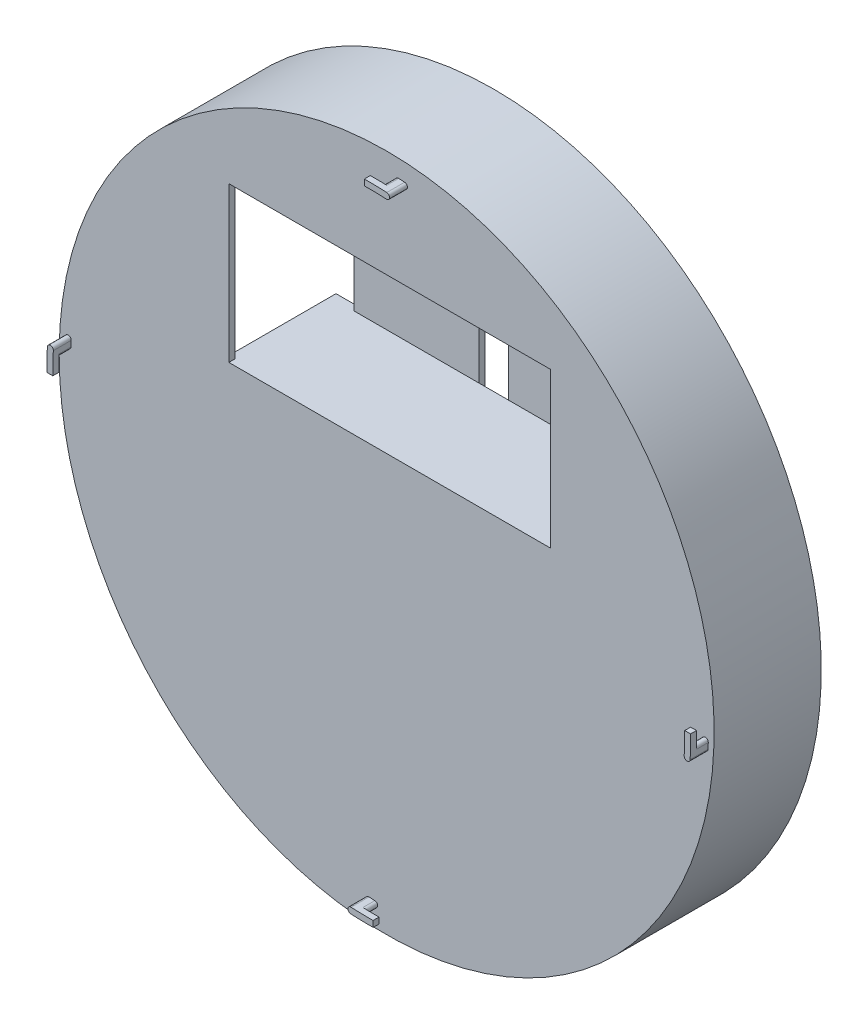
ISO-10303-21;
HEADER;
FILE_DESCRIPTION(('STEP AP214'),'2;1');
FILE_NAME('part.step','',(''),(''),'','','');
FILE_SCHEMA(('AUTOMOTIVE_DESIGN { 1 0 10303 214 1 1 1 1 }'));
ENDSEC;
DATA;
#1=APPLICATION_CONTEXT('core data for automotive mechanical design processes');
#2=APPLICATION_PROTOCOL_DEFINITION('international standard','automotive_design',2000,#1);
#3=PRODUCT_CONTEXT('',#1,'mechanical');
#4=PRODUCT('Part','Part','',(#3));
#5=PRODUCT_RELATED_PRODUCT_CATEGORY('part','',(#4));
#6=PRODUCT_DEFINITION_FORMATION('','',#4);
#7=PRODUCT_DEFINITION_CONTEXT('part definition',#1,'design');
#8=PRODUCT_DEFINITION('design','',#6,#7);
#9=PRODUCT_DEFINITION_SHAPE('','',#8);
#10=(LENGTH_UNIT() NAMED_UNIT(*) SI_UNIT(.MILLI.,.METRE.));
#11=(NAMED_UNIT(*) PLANE_ANGLE_UNIT() SI_UNIT($,.RADIAN.));
#12=(NAMED_UNIT(*) SI_UNIT($,.STERADIAN.) SOLID_ANGLE_UNIT());
#13=UNCERTAINTY_MEASURE_WITH_UNIT(LENGTH_MEASURE(1.E-05),#10,'distance_accuracy_value','');
#14=(GEOMETRIC_REPRESENTATION_CONTEXT(3) GLOBAL_UNCERTAINTY_ASSIGNED_CONTEXT((#13)) GLOBAL_UNIT_ASSIGNED_CONTEXT((#10,
#11,#12)) REPRESENTATION_CONTEXT('',''));
#15=CARTESIAN_POINT('',(0.,0.,0.));
#16=DIRECTION('',(0.,0.,1.));
#17=DIRECTION('',(1.,0.,0.));
#18=AXIS2_PLACEMENT_3D('',#15,#16,#17);
#19=CARTESIAN_POINT('',(0.,0.,18.));
#20=DIRECTION('',(0.,0.,1.));
#21=DIRECTION('',(1.,0.,0.));
#22=AXIS2_PLACEMENT_3D('',#19,#20,#21);
#23=PLANE('',#22);
#24=DIRECTION('',(0.,1.,0.));
#25=VECTOR('',#24,1.);
#26=CARTESIAN_POINT('',(27.5,39.,18.));
#27=LINE('',#26,#25);
#28=CARTESIAN_POINT('',(27.5,13.,18.));
#29=VERTEX_POINT('',#28);
#30=CARTESIAN_POINT('',(27.5,39.,18.));
#31=VERTEX_POINT('',#30);
#32=EDGE_CURVE('E816',#29,#31,#27,.T.);
#33=ORIENTED_EDGE('',*,*,#32,.F.);
#34=DIRECTION('',(1.,0.,0.));
#35=VECTOR('',#34,1.);
#36=CARTESIAN_POINT('',(-26.5,13.,18.));
#37=LINE('',#36,#35);
#38=CARTESIAN_POINT('',(-26.5,13.,18.));
#39=VERTEX_POINT('',#38);
#40=EDGE_CURVE('E808',#39,#29,#37,.T.);
#41=ORIENTED_EDGE('',*,*,#40,.F.);
#42=DIRECTION('',(0.,-1.,0.));
#43=VECTOR('',#42,1.);
#44=CARTESIAN_POINT('',(-26.5,39.,18.));
#45=LINE('',#44,#43);
#46=CARTESIAN_POINT('',(-26.5,39.,18.));
#47=VERTEX_POINT('',#46);
#48=EDGE_CURVE('E821',#47,#39,#45,.T.);
#49=ORIENTED_EDGE('',*,*,#48,.F.);
#50=DIRECTION('',(-1.,0.,0.));
#51=VECTOR('',#50,1.);
#52=CARTESIAN_POINT('',(-26.5,39.,18.));
#53=LINE('',#52,#51);
#54=EDGE_CURVE('E818',#31,#47,#53,.T.);
#55=ORIENTED_EDGE('',*,*,#54,.F.);
#56=EDGE_LOOP('',(#33,#41,#49,#55));
#57=FACE_BOUND('',#56,.T.);
#58=CARTESIAN_POINT('',(0.,0.,18.));
#59=DIRECTION('',(0.,0.,1.));
#60=DIRECTION('',(0.,1.,0.));
#61=AXIS2_PLACEMENT_3D('',#58,#59,#60);
#62=ELLIPSE('',#61,57.,55.);
#63=CARTESIAN_POINT('',(0.,57.,18.));
#64=VERTEX_POINT('',#63);
#65=EDGE_CURVE('E11',#64,#64,#62,.T.);
#66=ORIENTED_EDGE('',*,*,#65,.T.);
#67=EDGE_LOOP('',(#66));
#68=FACE_BOUND('',#67,.T.);
#69=CARTESIAN_POINT('',(0.,0.,18.));
#70=DIRECTION('',(0.,0.,1.));
#71=DIRECTION('',(1.,0.,0.));
#72=AXIS2_PLACEMENT_3D('',#69,#70,#71);
#73=CIRCLE('',#72,54.0583844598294);
#74=CARTESIAN_POINT('',(-53.9735129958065,3.0280068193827,18.));
#75=VERTEX_POINT('',#74);
#76=CARTESIAN_POINT('',(-54.0206802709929,2.01867121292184,18.));
#77=VERTEX_POINT('',#76);
#78=EDGE_CURVE('E592',#75,#77,#73,.T.);
#79=ORIENTED_EDGE('',*,*,#78,.F.);
#80=CARTESIAN_POINT('',(-53.4742979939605,3.,18.));
#81=DIRECTION('',(0.,0.,1.));
#82=DIRECTION('',(1.,0.,0.));
#83=AXIS2_PLACEMENT_3D('',#80,#81,#82);
#84=CIRCLE('',#83,0.500000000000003);
#85=CARTESIAN_POINT('',(-52.9750829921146,2.97199318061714,18.));
#86=VERTEX_POINT('',#85);
#87=EDGE_CURVE('E575',#86,#75,#84,.T.);
#88=ORIENTED_EDGE('',*,*,#87,.F.);
#89=CARTESIAN_POINT('',(0.,0.,18.));
#90=DIRECTION('',(0.,0.,-1.));
#91=DIRECTION('',(1.,0.,0.));
#92=AXIS2_PLACEMENT_3D('',#89,#90,#91);
#93=CIRCLE('',#92,53.0583844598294);
#94=CARTESIAN_POINT('',(-53.0213777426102,1.98132878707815,18.));
#95=VERTEX_POINT('',#94);
#96=EDGE_CURVE('E585',#95,#86,#93,.T.);
#97=ORIENTED_EDGE('',*,*,#96,.F.);
#98=CARTESIAN_POINT('',(-53.5210290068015,2.,18.));
#99=DIRECTION('',(0.,0.,1.));
#100=DIRECTION('',(1.,0.,0.));
#101=AXIS2_PLACEMENT_3D('',#98,#99,#100);
#102=CIRCLE('',#101,0.500000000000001);
#103=EDGE_CURVE('E595',#77,#95,#102,.T.);
#104=ORIENTED_EDGE('',*,*,#103,.F.);
#105=EDGE_LOOP('',(#79,#88,#97,#104));
#106=FACE_BOUND('',#105,.T.);
#107=CARTESIAN_POINT('',(0.,0.,18.));
#108=DIRECTION('',(0.,0.,1.));
#109=DIRECTION('',(1.,0.,0.));
#110=AXIS2_PLACEMENT_3D('',#107,#108,#109);
#111=CIRCLE('',#110,54.0583844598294);
#112=CARTESIAN_POINT('',(3.02800681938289,53.9735129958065,18.));
#113=VERTEX_POINT('',#112);
#114=CARTESIAN_POINT('',(2.01867121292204,54.0206802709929,18.));
#115=VERTEX_POINT('',#114);
#116=EDGE_CURVE('E569',#113,#115,#111,.T.);
#117=ORIENTED_EDGE('',*,*,#116,.F.);
#118=CARTESIAN_POINT('',(3.00000000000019,53.4742979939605,18.));
#119=DIRECTION('',(0.,0.,1.));
#120=DIRECTION('',(1.,0.,0.));
#121=AXIS2_PLACEMENT_3D('',#118,#119,#120);
#122=CIRCLE('',#121,0.5);
#123=CARTESIAN_POINT('',(2.97199318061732,52.9750829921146,18.));
#124=VERTEX_POINT('',#123);
#125=EDGE_CURVE('E572',#124,#113,#122,.T.);
#126=ORIENTED_EDGE('',*,*,#125,.F.);
#127=CARTESIAN_POINT('',(0.,0.,18.));
#128=DIRECTION('',(0.,0.,-1.));
#129=DIRECTION('',(1.,0.,0.));
#130=AXIS2_PLACEMENT_3D('',#127,#128,#129);
#131=CIRCLE('',#130,53.0583844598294);
#132=CARTESIAN_POINT('',(1.98132878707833,53.0213777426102,18.));
#133=VERTEX_POINT('',#132);
#134=EDGE_CURVE('E562',#133,#124,#131,.T.);
#135=ORIENTED_EDGE('',*,*,#134,.F.);
#136=CARTESIAN_POINT('',(2.00000000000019,53.5210290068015,18.));
#137=DIRECTION('',(0.,0.,1.));
#138=DIRECTION('',(1.,0.,0.));
#139=AXIS2_PLACEMENT_3D('',#136,#137,#138);
#140=CIRCLE('',#139,0.500000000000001);
#141=EDGE_CURVE('E565',#115,#133,#140,.T.);
#142=ORIENTED_EDGE('',*,*,#141,.F.);
#143=EDGE_LOOP('',(#117,#126,#135,#142));
#144=FACE_BOUND('',#143,.T.);
#145=CARTESIAN_POINT('',(0.,0.,18.));
#146=DIRECTION('',(0.,0.,1.));
#147=DIRECTION('',(1.,0.,0.));
#148=AXIS2_PLACEMENT_3D('',#145,#146,#147);
#149=CIRCLE('',#148,54.0583844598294);
#150=CARTESIAN_POINT('',(53.9735129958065,-3.02800681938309,18.));
#151=VERTEX_POINT('',#150);
#152=CARTESIAN_POINT('',(54.0206802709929,-2.01867121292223,18.));
#153=VERTEX_POINT('',#152);
#154=EDGE_CURVE('E542',#151,#153,#149,.T.);
#155=ORIENTED_EDGE('',*,*,#154,.F.);
#156=CARTESIAN_POINT('',(53.4742979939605,-3.00000000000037,18.));
#157=DIRECTION('',(0.,0.,1.));
#158=DIRECTION('',(1.,0.,0.));
#159=AXIS2_PLACEMENT_3D('',#156,#157,#158);
#160=CIRCLE('',#159,0.500000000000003);
#161=CARTESIAN_POINT('',(52.9750829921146,-2.97199318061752,18.));
#162=VERTEX_POINT('',#161);
#163=EDGE_CURVE('E545',#162,#151,#160,.T.);
#164=ORIENTED_EDGE('',*,*,#163,.F.);
#165=CARTESIAN_POINT('',(0.,0.,18.));
#166=DIRECTION('',(0.,0.,-1.));
#167=DIRECTION('',(1.,0.,0.));
#168=AXIS2_PLACEMENT_3D('',#165,#166,#167);
#169=CIRCLE('',#168,53.0583844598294);
#170=CARTESIAN_POINT('',(53.0213777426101,-1.98132878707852,18.));
#171=VERTEX_POINT('',#170);
#172=EDGE_CURVE('E537',#171,#162,#169,.T.);
#173=ORIENTED_EDGE('',*,*,#172,.F.);
#174=CARTESIAN_POINT('',(53.5210290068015,-2.00000000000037,18.));
#175=DIRECTION('',(0.,0.,1.));
#176=DIRECTION('',(1.,0.,0.));
#177=AXIS2_PLACEMENT_3D('',#174,#175,#176);
#178=CIRCLE('',#177,0.500000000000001);
#179=EDGE_CURVE('E539',#153,#171,#178,.T.);
#180=ORIENTED_EDGE('',*,*,#179,.F.);
#181=EDGE_LOOP('',(#155,#164,#173,#180));
#182=FACE_BOUND('',#181,.T.);
#183=CARTESIAN_POINT('',(0.,0.,18.));
#184=DIRECTION('',(0.,0.,1.));
#185=DIRECTION('',(1.,0.,0.));
#186=AXIS2_PLACEMENT_3D('',#183,#184,#185);
#187=CIRCLE('',#186,54.0583844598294);
#188=CARTESIAN_POINT('',(-3.02800681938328,-53.9735129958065,18.));
#189=VERTEX_POINT('',#188);
#190=CARTESIAN_POINT('',(-2.01867121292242,-54.0206802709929,18.));
#191=VERTEX_POINT('',#190);
#192=EDGE_CURVE('E521',#189,#191,#187,.T.);
#193=ORIENTED_EDGE('',*,*,#192,.F.);
#194=CARTESIAN_POINT('',(-3.00000000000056,-53.4742979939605,18.));
#195=DIRECTION('',(0.,0.,1.));
#196=DIRECTION('',(1.,0.,0.));
#197=AXIS2_PLACEMENT_3D('',#194,#195,#196);
#198=CIRCLE('',#197,0.5);
#199=CARTESIAN_POINT('',(-2.97199318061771,-52.9750829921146,18.));
#200=VERTEX_POINT('',#199);
#201=EDGE_CURVE('E524',#200,#189,#198,.T.);
#202=ORIENTED_EDGE('',*,*,#201,.F.);
#203=CARTESIAN_POINT('',(0.,0.,18.));
#204=DIRECTION('',(0.,0.,-1.));
#205=DIRECTION('',(1.,0.,0.));
#206=AXIS2_PLACEMENT_3D('',#203,#204,#205);
#207=CIRCLE('',#206,53.0583844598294);
#208=CARTESIAN_POINT('',(-1.9813287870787,-53.0213777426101,18.));
#209=VERTEX_POINT('',#208);
#210=EDGE_CURVE('E517',#209,#200,#207,.T.);
#211=ORIENTED_EDGE('',*,*,#210,.F.);
#212=CARTESIAN_POINT('',(-2.00000000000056,-53.5210290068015,18.));
#213=DIRECTION('',(0.,0.,1.));
#214=DIRECTION('',(1.,0.,0.));
#215=AXIS2_PLACEMENT_3D('',#212,#213,#214);
#216=CIRCLE('',#215,0.500000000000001);
#217=EDGE_CURVE('E519',#191,#209,#216,.T.);
#218=ORIENTED_EDGE('',*,*,#217,.F.);
#219=EDGE_LOOP('',(#193,#202,#211,#218));
#220=FACE_BOUND('',#219,.T.);
#221=ADVANCED_FACE('F41',(#57,#68,#106,#144,#182,#220),#23,.T.);
#222=CARTESIAN_POINT('',(-27.5,40.,-0.999999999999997));
#223=DIRECTION('',(1.,0.,0.));
#224=DIRECTION('',(0.,0.,-1.));
#225=AXIS2_PLACEMENT_3D('',#222,#223,#224);
#226=PLANE('',#225);
#227=DIRECTION('',(0.,1.,0.));
#228=VECTOR('',#227,1.);
#229=CARTESIAN_POINT('',(-27.5,40.,17.));
#230=LINE('',#229,#228);
#231=CARTESIAN_POINT('',(-27.5,12.,17.));
#232=VERTEX_POINT('',#231);
#233=CARTESIAN_POINT('',(-27.5,13.,17.));
#234=VERTEX_POINT('',#233);
#235=EDGE_CURVE('E850',#232,#234,#230,.T.);
#236=ORIENTED_EDGE('',*,*,#235,.T.);
#237=DIRECTION('',(0.,0.,-1.));
#238=VECTOR('',#237,1.);
#239=CARTESIAN_POINT('',(-27.5,13.,17.));
#240=LINE('',#239,#238);
#241=CARTESIAN_POINT('',(-27.5,13.,-0.999999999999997));
#242=VERTEX_POINT('',#241);
#243=EDGE_CURVE('E625',#234,#242,#240,.T.);
#244=ORIENTED_EDGE('',*,*,#243,.T.);
#245=DIRECTION('',(0.,1.,0.));
#246=VECTOR('',#245,1.);
#247=CARTESIAN_POINT('',(-27.5,40.,-0.999999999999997));
#248=LINE('',#247,#246);
#249=CARTESIAN_POINT('',(-27.5,12.,-0.999999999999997));
#250=VERTEX_POINT('',#249);
#251=EDGE_CURVE('E835',#250,#242,#248,.T.);
#252=ORIENTED_EDGE('',*,*,#251,.F.);
#253=DIRECTION('',(0.,0.,1.));
#254=VECTOR('',#253,1.);
#255=CARTESIAN_POINT('',(-27.5,12.,-0.999999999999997));
#256=LINE('',#255,#254);
#257=EDGE_CURVE('E849',#250,#232,#256,.T.);
#258=ORIENTED_EDGE('',*,*,#257,.T.);
#259=EDGE_LOOP('',(#236,#244,#252,#258));
#260=FACE_BOUND('',#259,.T.);
#261=ADVANCED_FACE('F901',(#260),#226,.F.);
#262=CARTESIAN_POINT('',(0.,0.,17.));
#263=DIRECTION('',(0.,0.,-1.));
#264=DIRECTION('',(-1.,0.,0.));
#265=AXIS2_PLACEMENT_3D('',#262,#263,#264);
#266=PLANE('',#265);
#267=CARTESIAN_POINT('',(0.,0.,17.));
#268=DIRECTION('',(0.,0.,-1.));
#269=DIRECTION('',(-1.,0.,0.));
#270=AXIS2_PLACEMENT_3D('',#267,#268,#269);
#271=CIRCLE('',#270,50.);
#272=CARTESIAN_POINT('',(-50.,0.,17.));
#273=VERTEX_POINT('',#272);
#274=EDGE_CURVE('E874',#273,#273,#271,.T.);
#275=ORIENTED_EDGE('',*,*,#274,.T.);
#276=EDGE_LOOP('',(#275));
#277=FACE_BOUND('',#276,.T.);
#278=DIRECTION('',(1.,0.,0.));
#279=VECTOR('',#278,1.);
#280=CARTESIAN_POINT('',(28.5,40.,17.));
#281=LINE('',#280,#279);
#282=CARTESIAN_POINT('',(5.5,40.,17.));
#283=VERTEX_POINT('',#282);
#284=CARTESIAN_POINT('',(28.5,40.,17.));
#285=VERTEX_POINT('',#284);
#286=EDGE_CURVE('E853',#283,#285,#281,.T.);
#287=ORIENTED_EDGE('',*,*,#286,.F.);
#288=DIRECTION('',(0.,-1.,0.));
#289=VECTOR('',#288,1.);
#290=CARTESIAN_POINT('',(5.5,46.,17.));
#291=LINE('',#290,#289);
#292=CARTESIAN_POINT('',(5.5,46.,17.));
#293=VERTEX_POINT('',#292);
#294=EDGE_CURVE('E685',#293,#283,#291,.T.);
#295=ORIENTED_EDGE('',*,*,#294,.F.);
#296=DIRECTION('',(1.,0.,0.));
#297=VECTOR('',#296,1.);
#298=CARTESIAN_POINT('',(5.5,46.,17.));
#299=LINE('',#298,#297);
#300=CARTESIAN_POINT('',(2.,46.,17.));
#301=VERTEX_POINT('',#300);
#302=EDGE_CURVE('E688',#301,#293,#299,.T.);
#303=ORIENTED_EDGE('',*,*,#302,.F.);
#304=DIRECTION('',(0.,1.,0.));
#305=VECTOR('',#304,1.);
#306=CARTESIAN_POINT('',(2.,46.,17.));
#307=LINE('',#306,#305);
#308=CARTESIAN_POINT('',(2.,45.,17.));
#309=VERTEX_POINT('',#308);
#310=EDGE_CURVE('E669',#309,#301,#307,.T.);
#311=ORIENTED_EDGE('',*,*,#310,.F.);
#312=DIRECTION('',(-1.,0.,0.));
#313=VECTOR('',#312,1.);
#314=CARTESIAN_POINT('',(2.,45.,17.));
#315=LINE('',#314,#313);
#316=CARTESIAN_POINT('',(4.5,45.,17.));
#317=VERTEX_POINT('',#316);
#318=EDGE_CURVE('E672',#317,#309,#315,.T.);
#319=ORIENTED_EDGE('',*,*,#318,.F.);
#320=DIRECTION('',(0.,1.,0.));
#321=VECTOR('',#320,1.);
#322=CARTESIAN_POINT('',(4.5,45.,17.));
#323=LINE('',#322,#321);
#324=CARTESIAN_POINT('',(4.5,41.,17.));
#325=VERTEX_POINT('',#324);
#326=EDGE_CURVE('E676',#325,#317,#323,.T.);
#327=ORIENTED_EDGE('',*,*,#326,.F.);
#328=DIRECTION('',(1.,0.,0.));
#329=VECTOR('',#328,1.);
#330=CARTESIAN_POINT('',(4.5,41.,17.));
#331=LINE('',#330,#329);
#332=CARTESIAN_POINT('',(2.,41.,17.));
#333=VERTEX_POINT('',#332);
#334=EDGE_CURVE('E679',#333,#325,#331,.T.);
#335=ORIENTED_EDGE('',*,*,#334,.F.);
#336=DIRECTION('',(0.,1.,0.));
#337=VECTOR('',#336,1.);
#338=CARTESIAN_POINT('',(2.,41.,17.));
#339=LINE('',#338,#337);
#340=CARTESIAN_POINT('',(2.,40.,17.));
#341=VERTEX_POINT('',#340);
#342=EDGE_CURVE('E682',#341,#333,#339,.T.);
#343=ORIENTED_EDGE('',*,*,#342,.F.);
#344=CARTESIAN_POINT('',(-1.99999999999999,40.,17.));
#345=VERTEX_POINT('',#344);
#346=EDGE_CURVE('E858',#345,#341,#281,.T.);
#347=ORIENTED_EDGE('',*,*,#346,.F.);
#348=DIRECTION('',(0.,-1.,0.));
#349=VECTOR('',#348,1.);
#350=CARTESIAN_POINT('',(-1.99999999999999,41.,17.));
#351=LINE('',#350,#349);
#352=CARTESIAN_POINT('',(-1.99999999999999,41.,17.));
#353=VERTEX_POINT('',#352);
#354=EDGE_CURVE('E739',#353,#345,#351,.T.);
#355=ORIENTED_EDGE('',*,*,#354,.F.);
#356=DIRECTION('',(1.,0.,0.));
#357=VECTOR('',#356,1.);
#358=CARTESIAN_POINT('',(-4.49999999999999,41.,17.));
#359=LINE('',#358,#357);
#360=CARTESIAN_POINT('',(-4.49999999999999,41.,17.));
#361=VERTEX_POINT('',#360);
#362=EDGE_CURVE('E737',#361,#353,#359,.T.);
#363=ORIENTED_EDGE('',*,*,#362,.F.);
#364=DIRECTION('',(0.,-1.,0.));
#365=VECTOR('',#364,1.);
#366=CARTESIAN_POINT('',(-4.5,45.,17.));
#367=LINE('',#366,#365);
#368=CARTESIAN_POINT('',(-4.5,45.,17.));
#369=VERTEX_POINT('',#368);
#370=EDGE_CURVE('E735',#369,#361,#367,.T.);
#371=ORIENTED_EDGE('',*,*,#370,.F.);
#372=DIRECTION('',(-1.,0.,0.));
#373=VECTOR('',#372,1.);
#374=CARTESIAN_POINT('',(-2.,45.,17.));
#375=LINE('',#374,#373);
#376=CARTESIAN_POINT('',(-2.,45.,17.));
#377=VERTEX_POINT('',#376);
#378=EDGE_CURVE('E733',#377,#369,#375,.T.);
#379=ORIENTED_EDGE('',*,*,#378,.F.);
#380=DIRECTION('',(0.,-1.,0.));
#381=VECTOR('',#380,1.);
#382=CARTESIAN_POINT('',(-2.,46.,17.));
#383=LINE('',#382,#381);
#384=CARTESIAN_POINT('',(-2.,46.,17.));
#385=VERTEX_POINT('',#384);
#386=EDGE_CURVE('E731',#385,#377,#383,.T.);
#387=ORIENTED_EDGE('',*,*,#386,.F.);
#388=DIRECTION('',(1.,0.,0.));
#389=VECTOR('',#388,1.);
#390=CARTESIAN_POINT('',(-5.5,46.,17.));
#391=LINE('',#390,#389);
#392=CARTESIAN_POINT('',(-5.5,46.,17.));
#393=VERTEX_POINT('',#392);
#394=EDGE_CURVE('E691',#393,#385,#391,.T.);
#395=ORIENTED_EDGE('',*,*,#394,.F.);
#396=DIRECTION('',(0.,1.,0.));
#397=VECTOR('',#396,1.);
#398=CARTESIAN_POINT('',(-5.5,46.,17.));
#399=LINE('',#398,#397);
#400=CARTESIAN_POINT('',(-5.49999999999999,40.,17.));
#401=VERTEX_POINT('',#400);
#402=EDGE_CURVE('E713',#401,#393,#399,.T.);
#403=ORIENTED_EDGE('',*,*,#402,.F.);
#404=CARTESIAN_POINT('',(-27.5,40.,17.));
#405=VERTEX_POINT('',#404);
#406=EDGE_CURVE('E854',#405,#401,#281,.T.);
#407=ORIENTED_EDGE('',*,*,#406,.F.);
#408=CARTESIAN_POINT('',(-27.5,39.,17.));
#409=VERTEX_POINT('',#408);
#410=EDGE_CURVE('E828',#409,#405,#230,.T.);
#411=ORIENTED_EDGE('',*,*,#410,.F.);
#412=DIRECTION('',(1.,0.,0.));
#413=VECTOR('',#412,1.);
#414=CARTESIAN_POINT('',(-27.5,39.,17.));
#415=LINE('',#414,#413);
#416=CARTESIAN_POINT('',(-26.5,39.,17.));
#417=VERTEX_POINT('',#416);
#418=EDGE_CURVE('E622',#409,#417,#415,.T.);
#419=ORIENTED_EDGE('',*,*,#418,.T.);
#420=DIRECTION('',(0.,1.,0.));
#421=VECTOR('',#420,1.);
#422=CARTESIAN_POINT('',(-26.5,39.,17.));
#423=LINE('',#422,#421);
#424=CARTESIAN_POINT('',(-26.5,13.,17.));
#425=VERTEX_POINT('',#424);
#426=EDGE_CURVE('E634',#425,#417,#423,.T.);
#427=ORIENTED_EDGE('',*,*,#426,.F.);
#428=DIRECTION('',(-1.,0.,0.));
#429=VECTOR('',#428,1.);
#430=CARTESIAN_POINT('',(-27.5,13.,17.));
#431=LINE('',#430,#429);
#432=EDGE_CURVE('E620',#425,#234,#431,.T.);
#433=ORIENTED_EDGE('',*,*,#432,.T.);
#434=ORIENTED_EDGE('',*,*,#235,.F.);
#435=DIRECTION('',(-1.,0.,0.));
#436=VECTOR('',#435,1.);
#437=CARTESIAN_POINT('',(28.5,12.,17.));
#438=LINE('',#437,#436);
#439=CARTESIAN_POINT('',(28.5,12.,17.));
#440=VERTEX_POINT('',#439);
#441=EDGE_CURVE('E861',#440,#232,#438,.T.);
#442=ORIENTED_EDGE('',*,*,#441,.F.);
#443=DIRECTION('',(0.,-1.,0.));
#444=VECTOR('',#443,1.);
#445=CARTESIAN_POINT('',(28.5,40.,17.));
#446=LINE('',#445,#444);
#447=EDGE_CURVE('E857',#285,#440,#446,.T.);
#448=ORIENTED_EDGE('',*,*,#447,.F.);
#449=EDGE_LOOP('',(#287,#295,#303,#311,#319,#327,#335,#343,#347,#355,#363,#371,#379,#387,#395,
#403,#407,#411,#419,#427,#433,#434,#442,#448));
#450=FACE_BOUND('',#449,.T.);
#451=ADVANCED_FACE('F909',(#277,#450),#266,.T.);
#452=CARTESIAN_POINT('',(28.5,40.,-0.999999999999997));
#453=DIRECTION('',(0.,-1.,0.));
#454=DIRECTION('',(0.,0.,-1.));
#455=AXIS2_PLACEMENT_3D('',#452,#453,#454);
#456=PLANE('',#455);
#457=DIRECTION('',(0.,0.,1.));
#458=VECTOR('',#457,1.);
#459=CARTESIAN_POINT('',(5.5,40.,7.));
#460=LINE('',#459,#458);
#461=CARTESIAN_POINT('',(5.5,40.,7.));
#462=VERTEX_POINT('',#461);
#463=EDGE_CURVE('E648',#462,#283,#460,.T.);
#464=ORIENTED_EDGE('',*,*,#463,.T.);
#465=ORIENTED_EDGE('',*,*,#286,.T.);
#466=DIRECTION('',(0.,0.,1.));
#467=VECTOR('',#466,1.);
#468=CARTESIAN_POINT('',(28.5,40.,-0.999999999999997));
#469=LINE('',#468,#467);
#470=CARTESIAN_POINT('',(28.5,40.,-0.999999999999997));
#471=VERTEX_POINT('',#470);
#472=EDGE_CURVE('E867',#471,#285,#469,.T.);
#473=ORIENTED_EDGE('',*,*,#472,.F.);
#474=DIRECTION('',(1.,0.,0.));
#475=VECTOR('',#474,1.);
#476=CARTESIAN_POINT('',(28.5,40.,-0.999999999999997));
#477=LINE('',#476,#475);
#478=CARTESIAN_POINT('',(2.5,40.,-0.999999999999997));
#479=VERTEX_POINT('',#478);
#480=EDGE_CURVE('E838',#479,#471,#477,.T.);
#481=ORIENTED_EDGE('',*,*,#480,.F.);
#482=DIRECTION('',(0.,0.,-1.));
#483=VECTOR('',#482,1.);
#484=CARTESIAN_POINT('',(2.5,40.,0.));
#485=LINE('',#484,#483);
#486=CARTESIAN_POINT('',(2.5,40.,3.));
#487=VERTEX_POINT('',#486);
#488=EDGE_CURVE('E794',#487,#479,#485,.T.);
#489=ORIENTED_EDGE('',*,*,#488,.F.);
#490=DIRECTION('',(1.,0.,0.));
#491=VECTOR('',#490,1.);
#492=CARTESIAN_POINT('',(-2.5,40.,3.));
#493=LINE('',#492,#491);
#494=CARTESIAN_POINT('',(-2.5,40.,3.));
#495=VERTEX_POINT('',#494);
#496=EDGE_CURVE('E767',#495,#487,#493,.T.);
#497=ORIENTED_EDGE('',*,*,#496,.F.);
#498=DIRECTION('',(0.,0.,-1.));
#499=VECTOR('',#498,1.);
#500=CARTESIAN_POINT('',(-2.49999999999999,40.,0.));
#501=LINE('',#500,#499);
#502=CARTESIAN_POINT('',(-2.49999999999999,40.,-0.999999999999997));
#503=VERTEX_POINT('',#502);
#504=EDGE_CURVE('E797',#495,#503,#501,.T.);
#505=ORIENTED_EDGE('',*,*,#504,.T.);
#506=CARTESIAN_POINT('',(-27.5,40.,-0.999999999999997));
#507=VERTEX_POINT('',#506);
#508=EDGE_CURVE('E840',#507,#503,#477,.T.);
#509=ORIENTED_EDGE('',*,*,#508,.F.);
#510=DIRECTION('',(0.,0.,1.));
#511=VECTOR('',#510,1.);
#512=CARTESIAN_POINT('',(-27.5,40.,-0.999999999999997));
#513=LINE('',#512,#511);
#514=EDGE_CURVE('E870',#507,#405,#513,.T.);
#515=ORIENTED_EDGE('',*,*,#514,.T.);
#516=ORIENTED_EDGE('',*,*,#406,.T.);
#517=DIRECTION('',(0.,0.,1.));
#518=VECTOR('',#517,1.);
#519=CARTESIAN_POINT('',(-5.49999999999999,40.,7.));
#520=LINE('',#519,#518);
#521=CARTESIAN_POINT('',(-5.49999999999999,40.,7.));
#522=VERTEX_POINT('',#521);
#523=EDGE_CURVE('E744',#522,#401,#520,.T.);
#524=ORIENTED_EDGE('',*,*,#523,.F.);
#525=DIRECTION('',(-1.,0.,0.));
#526=VECTOR('',#525,1.);
#527=CARTESIAN_POINT('',(-1.99999999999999,40.,7.));
#528=LINE('',#527,#526);
#529=CARTESIAN_POINT('',(-1.99999999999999,40.,7.));
#530=VERTEX_POINT('',#529);
#531=EDGE_CURVE('E724',#530,#522,#528,.T.);
#532=ORIENTED_EDGE('',*,*,#531,.F.);
#533=DIRECTION('',(0.,0.,1.));
#534=VECTOR('',#533,1.);
#535=CARTESIAN_POINT('',(-1.99999999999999,40.,7.));
#536=LINE('',#535,#534);
#537=EDGE_CURVE('E746',#530,#345,#536,.T.);
#538=ORIENTED_EDGE('',*,*,#537,.T.);
#539=ORIENTED_EDGE('',*,*,#346,.T.);
#540=DIRECTION('',(0.,0.,1.));
#541=VECTOR('',#540,1.);
#542=CARTESIAN_POINT('',(2.,40.,7.));
#543=LINE('',#542,#541);
#544=CARTESIAN_POINT('',(2.,40.,7.));
#545=VERTEX_POINT('',#544);
#546=EDGE_CURVE('E650',#545,#341,#543,.T.);
#547=ORIENTED_EDGE('',*,*,#546,.F.);
#548=DIRECTION('',(-1.,0.,0.));
#549=VECTOR('',#548,1.);
#550=CARTESIAN_POINT('',(2.,40.,7.));
#551=LINE('',#550,#549);
#552=EDGE_CURVE('E701',#462,#545,#551,.T.);
#553=ORIENTED_EDGE('',*,*,#552,.F.);
#554=EDGE_LOOP('',(#464,#465,#473,#481,#489,#497,#505,#509,#515,#516,#524,#532,#538,#539,#547,#553));
#555=FACE_BOUND('',#554,.T.);
#556=ADVANCED_FACE('F920',(#555),#456,.F.);
#557=CARTESIAN_POINT('',(0.,0.,0.));
#558=DIRECTION('',(0.,0.,1.));
#559=DIRECTION('',(1.,0.,0.));
#560=AXIS2_PLACEMENT_3D('',#557,#558,#559);
#561=PLANE('',#560);
#562=DIRECTION('',(-1.,0.,0.));
#563=VECTOR('',#562,1.);
#564=CARTESIAN_POINT('',(-26.5,39.,0.));
#565=LINE('',#564,#563);
#566=CARTESIAN_POINT('',(27.5,39.,0.));
#567=VERTEX_POINT('',#566);
#568=CARTESIAN_POINT('',(2.5,39.,0.));
#569=VERTEX_POINT('',#568);
#570=EDGE_CURVE('E809',#567,#569,#565,.T.);
#571=ORIENTED_EDGE('',*,*,#570,.T.);
#572=DIRECTION('',(0.,-1.,0.));
#573=VECTOR('',#572,1.);
#574=CARTESIAN_POINT('',(2.5,12.,0.));
#575=LINE('',#574,#573);
#576=CARTESIAN_POINT('',(2.5,13.,0.));
#577=VERTEX_POINT('',#576);
#578=EDGE_CURVE('E782',#569,#577,#575,.T.);
#579=ORIENTED_EDGE('',*,*,#578,.T.);
#580=DIRECTION('',(1.,0.,0.));
#581=VECTOR('',#580,1.);
#582=CARTESIAN_POINT('',(-26.5,13.,0.));
#583=LINE('',#582,#581);
#584=CARTESIAN_POINT('',(27.5,13.,0.));
#585=VERTEX_POINT('',#584);
#586=EDGE_CURVE('E812',#577,#585,#583,.T.);
#587=ORIENTED_EDGE('',*,*,#586,.T.);
#588=DIRECTION('',(0.,1.,0.));
#589=VECTOR('',#588,1.);
#590=CARTESIAN_POINT('',(27.5,39.,0.));
#591=LINE('',#590,#589);
#592=EDGE_CURVE('E804',#585,#567,#591,.T.);
#593=ORIENTED_EDGE('',*,*,#592,.T.);
#594=EDGE_LOOP('',(#571,#579,#587,#593));
#595=FACE_BOUND('',#594,.T.);
#596=ADVANCED_FACE('F928',(#595),#561,.T.);
#597=DIRECTION('',(0.,1.,0.));
#598=VECTOR('',#597,1.);
#599=CARTESIAN_POINT('',(-23.5,0.,0.));
#600=LINE('',#599,#598);
#601=CARTESIAN_POINT('',(-23.5,13.,0.));
#602=VERTEX_POINT('',#601);
#603=CARTESIAN_POINT('',(-23.5,39.,0.));
#604=VERTEX_POINT('',#603);
#605=EDGE_CURVE('E643',#602,#604,#600,.T.);
#606=ORIENTED_EDGE('',*,*,#605,.F.);
#607=CARTESIAN_POINT('',(-2.5,13.,0.));
#608=VERTEX_POINT('',#607);
#609=EDGE_CURVE('E813',#602,#608,#583,.T.);
#610=ORIENTED_EDGE('',*,*,#609,.T.);
#611=DIRECTION('',(0.,1.,0.));
#612=VECTOR('',#611,1.);
#613=CARTESIAN_POINT('',(-2.5,12.,0.));
#614=LINE('',#613,#612);
#615=CARTESIAN_POINT('',(-2.5,39.,0.));
#616=VERTEX_POINT('',#615);
#617=EDGE_CURVE('E787',#608,#616,#614,.T.);
#618=ORIENTED_EDGE('',*,*,#617,.T.);
#619=EDGE_CURVE('E807',#616,#604,#565,.T.);
#620=ORIENTED_EDGE('',*,*,#619,.T.);
#621=EDGE_LOOP('',(#606,#610,#618,#620));
#622=FACE_BOUND('',#621,.T.);
#623=ADVANCED_FACE('F895',(#622),#561,.T.);
#624=CARTESIAN_POINT('',(0.,0.,-0.999999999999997));
#625=DIRECTION('',(0.,0.,-1.));
#626=DIRECTION('',(-1.,0.,0.));
#627=AXIS2_PLACEMENT_3D('',#624,#625,#626);
#628=PLANE('',#627);
#629=CARTESIAN_POINT('',(9.5,26.,-0.999999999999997));
#630=DIRECTION('',(0.,0.,-1.));
#631=DIRECTION('',(-1.,0.,0.));
#632=AXIS2_PLACEMENT_3D('',#629,#630,#631);
#633=CIRCLE('',#632,3.);
#634=CARTESIAN_POINT('',(6.5,26.,-0.999999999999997));
#635=VERTEX_POINT('',#634);
#636=EDGE_CURVE('E611',#635,#635,#633,.T.);
#637=ORIENTED_EDGE('',*,*,#636,.F.);
#638=EDGE_LOOP('',(#637));
#639=FACE_BOUND('',#638,.T.);
#640=DIRECTION('',(0.,-1.,0.));
#641=VECTOR('',#640,1.);
#642=CARTESIAN_POINT('',(2.5,12.,-0.999999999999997));
#643=LINE('',#642,#641);
#644=CARTESIAN_POINT('',(2.5,12.,-0.999999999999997));
#645=VERTEX_POINT('',#644);
#646=EDGE_CURVE('E779',#479,#645,#643,.T.);
#647=ORIENTED_EDGE('',*,*,#646,.F.);
#648=ORIENTED_EDGE('',*,*,#480,.T.);
#649=DIRECTION('',(0.,-1.,0.));
#650=VECTOR('',#649,1.);
#651=CARTESIAN_POINT('',(28.5,40.,-0.999999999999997));
#652=LINE('',#651,#650);
#653=CARTESIAN_POINT('',(28.5,12.,-0.999999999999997));
#654=VERTEX_POINT('',#653);
#655=EDGE_CURVE('E843',#471,#654,#652,.T.);
#656=ORIENTED_EDGE('',*,*,#655,.T.);
#657=DIRECTION('',(-1.,0.,0.));
#658=VECTOR('',#657,1.);
#659=CARTESIAN_POINT('',(28.5,12.,-0.999999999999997));
#660=LINE('',#659,#658);
#661=EDGE_CURVE('E846',#654,#645,#660,.T.);
#662=ORIENTED_EDGE('',*,*,#661,.T.);
#663=EDGE_LOOP('',(#647,#648,#656,#662));
#664=FACE_BOUND('',#663,.T.);
#665=ADVANCED_FACE('F890',(#639,#664),#628,.T.);
#666=DIRECTION('',(0.,0.,-1.));
#667=VECTOR('',#666,1.);
#668=SURFACE_OF_LINEAR_EXTRUSION('',#62,#667);
#669=ORIENTED_EDGE('',*,*,#65,.F.);
#670=EDGE_LOOP('',(#669));
#671=FACE_BOUND('',#670,.T.);
#672=CARTESIAN_POINT('',(0.,0.,0.));
#673=DIRECTION('',(0.,0.,1.));
#674=DIRECTION('',(0.,1.,0.));
#675=AXIS2_PLACEMENT_3D('',#672,#673,#674);
#676=ELLIPSE('',#675,57.,55.);
#677=CARTESIAN_POINT('',(0.,57.,0.));
#678=VERTEX_POINT('',#677);
#679=EDGE_CURVE('E46',#678,#678,#676,.T.);
#680=ORIENTED_EDGE('',*,*,#679,.T.);
#681=EDGE_LOOP('',(#680));
#682=FACE_BOUND('',#681,.T.);
#683=ADVANCED_FACE('F43',(#671,#682),#668,.F.);
#684=CARTESIAN_POINT('',(0.,0.,0.));
#685=DIRECTION('',(0.,0.,1.));
#686=DIRECTION('',(1.,0.,0.));
#687=AXIS2_PLACEMENT_3D('',#684,#685,#686);
#688=PLANE('',#687);
#689=CARTESIAN_POINT('',(0.,0.,0.));
#690=DIRECTION('',(0.,0.,-1.));
#691=DIRECTION('',(-1.,0.,0.));
#692=AXIS2_PLACEMENT_3D('',#689,#690,#691);
#693=CIRCLE('',#692,50.);
#694=CARTESIAN_POINT('',(-50.,0.,0.));
#695=VERTEX_POINT('',#694);
#696=EDGE_CURVE('E873',#695,#695,#693,.T.);
#697=ORIENTED_EDGE('',*,*,#696,.F.);
#698=EDGE_LOOP('',(#697));
#699=FACE_BOUND('',#698,.T.);
#700=ORIENTED_EDGE('',*,*,#679,.F.);
#701=EDGE_LOOP('',(#700));
#702=FACE_BOUND('',#701,.T.);
#703=ADVANCED_FACE('F883',(#699,#702),#688,.F.);
#704=CARTESIAN_POINT('',(0.,0.,17.));
#705=DIRECTION('',(0.,0.,-1.));
#706=DIRECTION('',(-1.,0.,0.));
#707=AXIS2_PLACEMENT_3D('',#704,#705,#706);
#708=CYLINDRICAL_SURFACE('',#707,50.);
#709=ORIENTED_EDGE('',*,*,#274,.F.);
#710=EDGE_LOOP('',(#709));
#711=FACE_BOUND('',#710,.T.);
#712=ORIENTED_EDGE('',*,*,#696,.T.);
#713=EDGE_LOOP('',(#712));
#714=FACE_BOUND('',#713,.T.);
#715=ADVANCED_FACE('F881',(#711,#714),#708,.F.);
#716=CARTESIAN_POINT('',(-27.5,39.,-0.999999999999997));
#717=VERTEX_POINT('',#716);
#718=EDGE_CURVE('E839',#717,#507,#248,.T.);
#719=ORIENTED_EDGE('',*,*,#718,.F.);
#720=DIRECTION('',(0.,0.,-1.));
#721=VECTOR('',#720,1.);
#722=CARTESIAN_POINT('',(-27.5,39.,17.));
#723=LINE('',#722,#721);
#724=EDGE_CURVE('E637',#409,#717,#723,.T.);
#725=ORIENTED_EDGE('',*,*,#724,.F.);
#726=ORIENTED_EDGE('',*,*,#410,.T.);
#727=ORIENTED_EDGE('',*,*,#514,.F.);
#728=EDGE_LOOP('',(#719,#725,#726,#727));
#729=FACE_BOUND('',#728,.T.);
#730=ADVANCED_FACE('F912',(#729),#226,.F.);
#731=CARTESIAN_POINT('',(28.5,40.,-0.999999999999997));
#732=DIRECTION('',(-1.,0.,0.));
#733=DIRECTION('',(0.,-1.,0.));
#734=AXIS2_PLACEMENT_3D('',#731,#732,#733);
#735=PLANE('',#734);
#736=ORIENTED_EDGE('',*,*,#447,.T.);
#737=DIRECTION('',(0.,0.,1.));
#738=VECTOR('',#737,1.);
#739=CARTESIAN_POINT('',(28.5,12.,-0.999999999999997));
#740=LINE('',#739,#738);
#741=EDGE_CURVE('E865',#654,#440,#740,.T.);
#742=ORIENTED_EDGE('',*,*,#741,.F.);
#743=ORIENTED_EDGE('',*,*,#655,.F.);
#744=ORIENTED_EDGE('',*,*,#472,.T.);
#745=EDGE_LOOP('',(#736,#742,#743,#744));
#746=FACE_BOUND('',#745,.T.);
#747=ADVANCED_FACE('F924',(#746),#735,.F.);
#748=CARTESIAN_POINT('',(28.5,12.,-0.999999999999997));
#749=DIRECTION('',(0.,1.,0.));
#750=DIRECTION('',(0.,0.,1.));
#751=AXIS2_PLACEMENT_3D('',#748,#749,#750);
#752=PLANE('',#751);
#753=DIRECTION('',(-1.,0.,0.));
#754=VECTOR('',#753,1.);
#755=CARTESIAN_POINT('',(2.5,12.,0.));
#756=LINE('',#755,#754);
#757=CARTESIAN_POINT('',(2.5,12.,0.));
#758=VERTEX_POINT('',#757);
#759=CARTESIAN_POINT('',(-2.5,12.,0.));
#760=VERTEX_POINT('',#759);
#761=EDGE_CURVE('E784',#758,#760,#756,.T.);
#762=ORIENTED_EDGE('',*,*,#761,.F.);
#763=DIRECTION('',(0.,0.,-1.));
#764=VECTOR('',#763,1.);
#765=CARTESIAN_POINT('',(2.5,12.,0.));
#766=LINE('',#765,#764);
#767=EDGE_CURVE('E791',#758,#645,#766,.T.);
#768=ORIENTED_EDGE('',*,*,#767,.T.);
#769=ORIENTED_EDGE('',*,*,#661,.F.);
#770=ORIENTED_EDGE('',*,*,#741,.T.);
#771=ORIENTED_EDGE('',*,*,#441,.T.);
#772=ORIENTED_EDGE('',*,*,#257,.F.);
#773=CARTESIAN_POINT('',(-2.5,12.,-0.999999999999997));
#774=VERTEX_POINT('',#773);
#775=EDGE_CURVE('E845',#774,#250,#660,.T.);
#776=ORIENTED_EDGE('',*,*,#775,.F.);
#777=DIRECTION('',(0.,0.,-1.));
#778=VECTOR('',#777,1.);
#779=CARTESIAN_POINT('',(-2.5,12.,0.));
#780=LINE('',#779,#778);
#781=EDGE_CURVE('E800',#760,#774,#780,.T.);
#782=ORIENTED_EDGE('',*,*,#781,.F.);
#783=EDGE_LOOP('',(#762,#768,#769,#770,#771,#772,#776,#782));
#784=FACE_BOUND('',#783,.T.);
#785=ADVANCED_FACE('F932',(#784),#752,.F.);
#786=CARTESIAN_POINT('',(-9.49999999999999,26.,-0.999999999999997));
#787=DIRECTION('',(0.,0.,-1.));
#788=DIRECTION('',(-1.,0.,0.));
#789=AXIS2_PLACEMENT_3D('',#786,#787,#788);
#790=CIRCLE('',#789,3.);
#791=CARTESIAN_POINT('',(-12.5,26.,-0.999999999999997));
#792=VERTEX_POINT('',#791);
#793=EDGE_CURVE('E608',#792,#792,#790,.T.);
#794=ORIENTED_EDGE('',*,*,#793,.F.);
#795=EDGE_LOOP('',(#794));
#796=FACE_BOUND('',#795,.T.);
#797=DIRECTION('',(-1.,0.,0.));
#798=VECTOR('',#797,1.);
#799=CARTESIAN_POINT('',(-27.5,13.,-0.999999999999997));
#800=LINE('',#799,#798);
#801=CARTESIAN_POINT('',(-23.5,13.,-0.999999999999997));
#802=VERTEX_POINT('',#801);
#803=EDGE_CURVE('E617',#802,#242,#800,.T.);
#804=ORIENTED_EDGE('',*,*,#803,.F.);
#805=DIRECTION('',(0.,-1.,0.));
#806=VECTOR('',#805,1.);
#807=CARTESIAN_POINT('',(-23.5,13.,-0.999999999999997));
#808=LINE('',#807,#806);
#809=CARTESIAN_POINT('',(-23.5,39.,-0.999999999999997));
#810=VERTEX_POINT('',#809);
#811=EDGE_CURVE('E623',#810,#802,#808,.T.);
#812=ORIENTED_EDGE('',*,*,#811,.F.);
#813=DIRECTION('',(1.,0.,0.));
#814=VECTOR('',#813,1.);
#815=CARTESIAN_POINT('',(-27.5,39.,-0.999999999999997));
#816=LINE('',#815,#814);
#817=EDGE_CURVE('E627',#717,#810,#816,.T.);
#818=ORIENTED_EDGE('',*,*,#817,.F.);
#819=ORIENTED_EDGE('',*,*,#718,.T.);
#820=ORIENTED_EDGE('',*,*,#508,.T.);
#821=DIRECTION('',(0.,1.,0.));
#822=VECTOR('',#821,1.);
#823=CARTESIAN_POINT('',(-2.5,12.,-0.999999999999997));
#824=LINE('',#823,#822);
#825=EDGE_CURVE('E783',#774,#503,#824,.T.);
#826=ORIENTED_EDGE('',*,*,#825,.F.);
#827=ORIENTED_EDGE('',*,*,#775,.T.);
#828=ORIENTED_EDGE('',*,*,#251,.T.);
#829=EDGE_LOOP('',(#804,#812,#818,#819,#820,#826,#827,#828));
#830=FACE_BOUND('',#829,.T.);
#831=ADVANCED_FACE('F898',(#796,#830),#628,.T.);
#832=CARTESIAN_POINT('',(27.5,39.,0.));
#833=DIRECTION('',(1.,0.,0.));
#834=DIRECTION('',(0.,1.,0.));
#835=AXIS2_PLACEMENT_3D('',#832,#833,#834);
#836=PLANE('',#835);
#837=ORIENTED_EDGE('',*,*,#32,.T.);
#838=DIRECTION('',(0.,0.,1.));
#839=VECTOR('',#838,1.);
#840=CARTESIAN_POINT('',(27.5,39.,0.));
#841=LINE('',#840,#839);
#842=EDGE_CURVE('E815',#567,#31,#841,.T.);
#843=ORIENTED_EDGE('',*,*,#842,.F.);
#844=ORIENTED_EDGE('',*,*,#592,.F.);
#845=DIRECTION('',(0.,0.,1.));
#846=VECTOR('',#845,1.);
#847=CARTESIAN_POINT('',(27.5,13.,0.));
#848=LINE('',#847,#846);
#849=EDGE_CURVE('E826',#585,#29,#848,.T.);
#850=ORIENTED_EDGE('',*,*,#849,.T.);
#851=EDGE_LOOP('',(#837,#843,#844,#850));
#852=FACE_BOUND('',#851,.T.);
#853=ADVANCED_FACE('F938',(#852),#836,.F.);
#854=CARTESIAN_POINT('',(-26.5,13.,0.));
#855=DIRECTION('',(0.,-1.,0.));
#856=DIRECTION('',(0.,0.,-1.));
#857=AXIS2_PLACEMENT_3D('',#854,#855,#856);
#858=PLANE('',#857);
#859=ORIENTED_EDGE('',*,*,#609,.F.);
#860=DIRECTION('',(0.,0.,-1.));
#861=VECTOR('',#860,1.);
#862=CARTESIAN_POINT('',(-23.5,13.,17.));
#863=LINE('',#862,#861);
#864=EDGE_CURVE('E632',#602,#802,#863,.T.);
#865=ORIENTED_EDGE('',*,*,#864,.T.);
#866=ORIENTED_EDGE('',*,*,#803,.T.);
#867=ORIENTED_EDGE('',*,*,#243,.F.);
#868=ORIENTED_EDGE('',*,*,#432,.F.);
#869=DIRECTION('',(0.,0.,1.));
#870=VECTOR('',#869,1.);
#871=CARTESIAN_POINT('',(-26.5,13.,0.));
#872=LINE('',#871,#870);
#873=EDGE_CURVE('E829',#425,#39,#872,.T.);
#874=ORIENTED_EDGE('',*,*,#873,.T.);
#875=ORIENTED_EDGE('',*,*,#40,.T.);
#876=ORIENTED_EDGE('',*,*,#849,.F.);
#877=ORIENTED_EDGE('',*,*,#586,.F.);
#878=EDGE_CURVE('E796',#608,#577,#583,.T.);
#879=ORIENTED_EDGE('',*,*,#878,.F.);
#880=EDGE_LOOP('',(#859,#865,#866,#867,#868,#874,#875,#876,#877,#879));
#881=FACE_BOUND('',#880,.T.);
#882=ADVANCED_FACE('F942',(#881),#858,.F.);
#883=CARTESIAN_POINT('',(-26.5,39.,0.));
#884=DIRECTION('',(-1.,0.,0.));
#885=DIRECTION('',(0.,0.,1.));
#886=AXIS2_PLACEMENT_3D('',#883,#884,#885);
#887=PLANE('',#886);
#888=ORIENTED_EDGE('',*,*,#873,.F.);
#889=ORIENTED_EDGE('',*,*,#426,.T.);
#890=DIRECTION('',(0.,0.,1.));
#891=VECTOR('',#890,1.);
#892=CARTESIAN_POINT('',(-26.5,39.,0.));
#893=LINE('',#892,#891);
#894=EDGE_CURVE('E831',#417,#47,#893,.T.);
#895=ORIENTED_EDGE('',*,*,#894,.T.);
#896=ORIENTED_EDGE('',*,*,#48,.T.);
#897=EDGE_LOOP('',(#888,#889,#895,#896));
#898=FACE_BOUND('',#897,.T.);
#899=ADVANCED_FACE('F948',(#898),#887,.F.);
#900=CARTESIAN_POINT('',(-26.5,39.,0.));
#901=DIRECTION('',(0.,1.,0.));
#902=DIRECTION('',(0.,0.,1.));
#903=AXIS2_PLACEMENT_3D('',#900,#901,#902);
#904=PLANE('',#903);
#905=DIRECTION('',(0.,0.,-1.));
#906=VECTOR('',#905,1.);
#907=CARTESIAN_POINT('',(-23.5,39.,17.));
#908=LINE('',#907,#906);
#909=EDGE_CURVE('E635',#604,#810,#908,.T.);
#910=ORIENTED_EDGE('',*,*,#909,.F.);
#911=ORIENTED_EDGE('',*,*,#619,.F.);
#912=DIRECTION('',(0.,0.,1.));
#913=VECTOR('',#912,1.);
#914=CARTESIAN_POINT('',(-2.5,39.,0.));
#915=LINE('',#914,#913);
#916=CARTESIAN_POINT('',(-2.5,39.,2.85714285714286));
#917=VERTEX_POINT('',#916);
#918=EDGE_CURVE('E776',#616,#917,#915,.T.);
#919=ORIENTED_EDGE('',*,*,#918,.T.);
#920=DIRECTION('',(-1.,0.,0.));
#921=VECTOR('',#920,1.);
#922=CARTESIAN_POINT('',(-26.5,39.,2.85714285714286));
#923=LINE('',#922,#921);
#924=CARTESIAN_POINT('',(2.5,39.,2.85714285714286));
#925=VERTEX_POINT('',#924);
#926=EDGE_CURVE('E772',#925,#917,#923,.T.);
#927=ORIENTED_EDGE('',*,*,#926,.F.);
#928=DIRECTION('',(0.,0.,1.));
#929=VECTOR('',#928,1.);
#930=CARTESIAN_POINT('',(2.5,39.,0.));
#931=LINE('',#930,#929);
#932=EDGE_CURVE('E774',#569,#925,#931,.T.);
#933=ORIENTED_EDGE('',*,*,#932,.F.);
#934=ORIENTED_EDGE('',*,*,#570,.F.);
#935=ORIENTED_EDGE('',*,*,#842,.T.);
#936=ORIENTED_EDGE('',*,*,#54,.T.);
#937=ORIENTED_EDGE('',*,*,#894,.F.);
#938=ORIENTED_EDGE('',*,*,#418,.F.);
#939=ORIENTED_EDGE('',*,*,#724,.T.);
#940=ORIENTED_EDGE('',*,*,#817,.T.);
#941=EDGE_LOOP('',(#910,#911,#919,#927,#933,#934,#935,#936,#937,#938,#939,#940));
#942=FACE_BOUND('',#941,.T.);
#943=ADVANCED_FACE('F944',(#942),#904,.F.);
#944=CARTESIAN_POINT('',(2.5,12.,0.));
#945=DIRECTION('',(1.,0.,0.));
#946=DIRECTION('',(0.,1.,0.));
#947=AXIS2_PLACEMENT_3D('',#944,#945,#946);
#948=PLANE('',#947);
#949=ORIENTED_EDGE('',*,*,#646,.T.);
#950=ORIENTED_EDGE('',*,*,#767,.F.);
#951=EDGE_CURVE('E780',#577,#758,#575,.T.);
#952=ORIENTED_EDGE('',*,*,#951,.F.);
#953=ORIENTED_EDGE('',*,*,#578,.F.);
#954=ORIENTED_EDGE('',*,*,#932,.T.);
#955=DIRECTION('',(0.,0.989949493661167,0.14142135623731));
#956=VECTOR('',#955,1.);
#957=CARTESIAN_POINT('',(2.5,12.,-0.999999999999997));
#958=LINE('',#957,#956);
#959=EDGE_CURVE('E763',#925,#487,#958,.T.);
#960=ORIENTED_EDGE('',*,*,#959,.T.);
#961=ORIENTED_EDGE('',*,*,#488,.T.);
#962=EDGE_LOOP('',(#949,#950,#952,#953,#954,#960,#961));
#963=FACE_BOUND('',#962,.T.);
#964=ADVANCED_FACE('F947',(#963),#948,.F.);
#965=CARTESIAN_POINT('',(-2.5,12.,0.));
#966=DIRECTION('',(-1.,0.,0.));
#967=DIRECTION('',(0.,-1.,0.));
#968=AXIS2_PLACEMENT_3D('',#965,#966,#967);
#969=PLANE('',#968);
#970=ORIENTED_EDGE('',*,*,#918,.F.);
#971=ORIENTED_EDGE('',*,*,#617,.F.);
#972=EDGE_CURVE('E788',#760,#608,#614,.T.);
#973=ORIENTED_EDGE('',*,*,#972,.F.);
#974=ORIENTED_EDGE('',*,*,#781,.T.);
#975=ORIENTED_EDGE('',*,*,#825,.T.);
#976=ORIENTED_EDGE('',*,*,#504,.F.);
#977=DIRECTION('',(0.,0.989949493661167,0.14142135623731));
#978=VECTOR('',#977,1.);
#979=CARTESIAN_POINT('',(-2.5,12.,-0.999999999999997));
#980=LINE('',#979,#978);
#981=EDGE_CURVE('E764',#917,#495,#980,.T.);
#982=ORIENTED_EDGE('',*,*,#981,.F.);
#983=EDGE_LOOP('',(#970,#971,#973,#974,#975,#976,#982));
#984=FACE_BOUND('',#983,.T.);
#985=ADVANCED_FACE('F961',(#984),#969,.F.);
#986=CARTESIAN_POINT('',(0.,0.,0.));
#987=DIRECTION('',(0.,0.,1.));
#988=DIRECTION('',(1.,0.,0.));
#989=AXIS2_PLACEMENT_3D('',#986,#987,#988);
#990=PLANE('',#989);
#991=ORIENTED_EDGE('',*,*,#878,.T.);
#992=ORIENTED_EDGE('',*,*,#951,.T.);
#993=ORIENTED_EDGE('',*,*,#761,.T.);
#994=ORIENTED_EDGE('',*,*,#972,.T.);
#995=EDGE_LOOP('',(#991,#992,#993,#994));
#996=FACE_BOUND('',#995,.T.);
#997=ADVANCED_FACE('F965',(#996),#990,.F.);
#998=CARTESIAN_POINT('',(-2.5,12.,-0.999999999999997));
#999=DIRECTION('',(0.,0.14142135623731,-0.989949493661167));
#1000=DIRECTION('',(0.,0.989949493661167,0.14142135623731));
#1001=AXIS2_PLACEMENT_3D('',#998,#999,#1000);
#1002=PLANE('',#1001);
#1003=ORIENTED_EDGE('',*,*,#926,.T.);
#1004=ORIENTED_EDGE('',*,*,#981,.T.);
#1005=ORIENTED_EDGE('',*,*,#496,.T.);
#1006=ORIENTED_EDGE('',*,*,#959,.F.);
#1007=EDGE_LOOP('',(#1003,#1004,#1005,#1006));
#1008=FACE_BOUND('',#1007,.T.);
#1009=ADVANCED_FACE('F969',(#1008),#1002,.T.);
#1010=CARTESIAN_POINT('',(-5.5,46.,7.));
#1011=DIRECTION('',(0.,-1.,0.));
#1012=DIRECTION('',(0.,0.,-1.));
#1013=AXIS2_PLACEMENT_3D('',#1010,#1011,#1012);
#1014=PLANE('',#1013);
#1015=ORIENTED_EDGE('',*,*,#394,.T.);
#1016=DIRECTION('',(0.,0.,1.));
#1017=VECTOR('',#1016,1.);
#1018=CARTESIAN_POINT('',(-2.,46.,7.));
#1019=LINE('',#1018,#1017);
#1020=CARTESIAN_POINT('',(-2.,46.,7.));
#1021=VERTEX_POINT('',#1020);
#1022=EDGE_CURVE('E761',#1021,#385,#1019,.T.);
#1023=ORIENTED_EDGE('',*,*,#1022,.F.);
#1024=DIRECTION('',(1.,0.,0.));
#1025=VECTOR('',#1024,1.);
#1026=CARTESIAN_POINT('',(-5.5,46.,7.));
#1027=LINE('',#1026,#1025);
#1028=CARTESIAN_POINT('',(-5.5,46.,7.));
#1029=VERTEX_POINT('',#1028);
#1030=EDGE_CURVE('E709',#1029,#1021,#1027,.T.);
#1031=ORIENTED_EDGE('',*,*,#1030,.F.);
#1032=DIRECTION('',(0.,0.,1.));
#1033=VECTOR('',#1032,1.);
#1034=CARTESIAN_POINT('',(-5.5,46.,7.));
#1035=LINE('',#1034,#1033);
#1036=EDGE_CURVE('E728',#1029,#393,#1035,.T.);
#1037=ORIENTED_EDGE('',*,*,#1036,.T.);
#1038=EDGE_LOOP('',(#1015,#1023,#1031,#1037));
#1039=FACE_BOUND('',#1038,.T.);
#1040=ADVANCED_FACE('F973',(#1039),#1014,.F.);
#1041=CARTESIAN_POINT('',(-2.,46.,7.));
#1042=DIRECTION('',(-1.,0.,0.));
#1043=DIRECTION('',(0.,-1.,0.));
#1044=AXIS2_PLACEMENT_3D('',#1041,#1042,#1043);
#1045=PLANE('',#1044);
#1046=ORIENTED_EDGE('',*,*,#386,.T.);
#1047=DIRECTION('',(0.,0.,1.));
#1048=VECTOR('',#1047,1.);
#1049=CARTESIAN_POINT('',(-2.,45.,7.));
#1050=LINE('',#1049,#1048);
#1051=CARTESIAN_POINT('',(-2.,45.,7.));
#1052=VERTEX_POINT('',#1051);
#1053=EDGE_CURVE('E758',#1052,#377,#1050,.T.);
#1054=ORIENTED_EDGE('',*,*,#1053,.F.);
#1055=DIRECTION('',(0.,-1.,0.));
#1056=VECTOR('',#1055,1.);
#1057=CARTESIAN_POINT('',(-2.,46.,7.));
#1058=LINE('',#1057,#1056);
#1059=EDGE_CURVE('E712',#1021,#1052,#1058,.T.);
#1060=ORIENTED_EDGE('',*,*,#1059,.F.);
#1061=ORIENTED_EDGE('',*,*,#1022,.T.);
#1062=EDGE_LOOP('',(#1046,#1054,#1060,#1061));
#1063=FACE_BOUND('',#1062,.T.);
#1064=ADVANCED_FACE('F977',(#1063),#1045,.F.);
#1065=CARTESIAN_POINT('',(-2.,45.,7.));
#1066=DIRECTION('',(0.,1.,0.));
#1067=DIRECTION('',(0.,0.,1.));
#1068=AXIS2_PLACEMENT_3D('',#1065,#1066,#1067);
#1069=PLANE('',#1068);
#1070=ORIENTED_EDGE('',*,*,#378,.T.);
#1071=DIRECTION('',(0.,0.,1.));
#1072=VECTOR('',#1071,1.);
#1073=CARTESIAN_POINT('',(-4.5,45.,7.));
#1074=LINE('',#1073,#1072);
#1075=CARTESIAN_POINT('',(-4.5,45.,7.));
#1076=VERTEX_POINT('',#1075);
#1077=EDGE_CURVE('E755',#1076,#369,#1074,.T.);
#1078=ORIENTED_EDGE('',*,*,#1077,.F.);
#1079=DIRECTION('',(-1.,0.,0.));
#1080=VECTOR('',#1079,1.);
#1081=CARTESIAN_POINT('',(-2.,45.,7.));
#1082=LINE('',#1081,#1080);
#1083=EDGE_CURVE('E715',#1052,#1076,#1082,.T.);
#1084=ORIENTED_EDGE('',*,*,#1083,.F.);
#1085=ORIENTED_EDGE('',*,*,#1053,.T.);
#1086=EDGE_LOOP('',(#1070,#1078,#1084,#1085));
#1087=FACE_BOUND('',#1086,.T.);
#1088=ADVANCED_FACE('F981',(#1087),#1069,.F.);
#1089=CARTESIAN_POINT('',(-4.5,45.,7.));
#1090=DIRECTION('',(-1.,0.,0.));
#1091=DIRECTION('',(0.,-1.,0.));
#1092=AXIS2_PLACEMENT_3D('',#1089,#1090,#1091);
#1093=PLANE('',#1092);
#1094=ORIENTED_EDGE('',*,*,#370,.T.);
#1095=DIRECTION('',(0.,0.,1.));
#1096=VECTOR('',#1095,1.);
#1097=CARTESIAN_POINT('',(-4.49999999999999,41.,7.));
#1098=LINE('',#1097,#1096);
#1099=CARTESIAN_POINT('',(-4.49999999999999,41.,7.));
#1100=VERTEX_POINT('',#1099);
#1101=EDGE_CURVE('E752',#1100,#361,#1098,.T.);
#1102=ORIENTED_EDGE('',*,*,#1101,.F.);
#1103=DIRECTION('',(0.,-1.,0.));
#1104=VECTOR('',#1103,1.);
#1105=CARTESIAN_POINT('',(-4.5,45.,7.));
#1106=LINE('',#1105,#1104);
#1107=EDGE_CURVE('E717',#1076,#1100,#1106,.T.);
#1108=ORIENTED_EDGE('',*,*,#1107,.F.);
#1109=ORIENTED_EDGE('',*,*,#1077,.T.);
#1110=EDGE_LOOP('',(#1094,#1102,#1108,#1109));
#1111=FACE_BOUND('',#1110,.T.);
#1112=ADVANCED_FACE('F985',(#1111),#1093,.F.);
#1113=CARTESIAN_POINT('',(-4.49999999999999,41.,7.));
#1114=DIRECTION('',(0.,-1.,0.));
#1115=DIRECTION('',(0.,0.,-1.));
#1116=AXIS2_PLACEMENT_3D('',#1113,#1114,#1115);
#1117=PLANE('',#1116);
#1118=ORIENTED_EDGE('',*,*,#362,.T.);
#1119=DIRECTION('',(0.,0.,1.));
#1120=VECTOR('',#1119,1.);
#1121=CARTESIAN_POINT('',(-1.99999999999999,41.,7.));
#1122=LINE('',#1121,#1120);
#1123=CARTESIAN_POINT('',(-1.99999999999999,41.,7.));
#1124=VERTEX_POINT('',#1123);
#1125=EDGE_CURVE('E749',#1124,#353,#1122,.T.);
#1126=ORIENTED_EDGE('',*,*,#1125,.F.);
#1127=DIRECTION('',(1.,0.,0.));
#1128=VECTOR('',#1127,1.);
#1129=CARTESIAN_POINT('',(-4.49999999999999,41.,7.));
#1130=LINE('',#1129,#1128);
#1131=EDGE_CURVE('E719',#1100,#1124,#1130,.T.);
#1132=ORIENTED_EDGE('',*,*,#1131,.F.);
#1133=ORIENTED_EDGE('',*,*,#1101,.T.);
#1134=EDGE_LOOP('',(#1118,#1126,#1132,#1133));
#1135=FACE_BOUND('',#1134,.T.);
#1136=ADVANCED_FACE('F989',(#1135),#1117,.F.);
#1137=CARTESIAN_POINT('',(-1.99999999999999,41.,7.));
#1138=DIRECTION('',(-1.,0.,0.));
#1139=DIRECTION('',(0.,-1.,0.));
#1140=AXIS2_PLACEMENT_3D('',#1137,#1138,#1139);
#1141=PLANE('',#1140);
#1142=ORIENTED_EDGE('',*,*,#354,.T.);
#1143=ORIENTED_EDGE('',*,*,#537,.F.);
#1144=DIRECTION('',(0.,-1.,0.));
#1145=VECTOR('',#1144,1.);
#1146=CARTESIAN_POINT('',(-1.99999999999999,41.,7.));
#1147=LINE('',#1146,#1145);
#1148=EDGE_CURVE('E721',#1124,#530,#1147,.T.);
#1149=ORIENTED_EDGE('',*,*,#1148,.F.);
#1150=ORIENTED_EDGE('',*,*,#1125,.T.);
#1151=EDGE_LOOP('',(#1142,#1143,#1149,#1150));
#1152=FACE_BOUND('',#1151,.T.);
#1153=ADVANCED_FACE('F993',(#1152),#1141,.F.);
#1154=CARTESIAN_POINT('',(-5.5,46.,7.));
#1155=DIRECTION('',(1.,0.,0.));
#1156=DIRECTION('',(0.,1.,0.));
#1157=AXIS2_PLACEMENT_3D('',#1154,#1155,#1156);
#1158=PLANE('',#1157);
#1159=ORIENTED_EDGE('',*,*,#402,.T.);
#1160=ORIENTED_EDGE('',*,*,#1036,.F.);
#1161=DIRECTION('',(0.,1.,0.));
#1162=VECTOR('',#1161,1.);
#1163=CARTESIAN_POINT('',(-5.5,46.,7.));
#1164=LINE('',#1163,#1162);
#1165=EDGE_CURVE('E726',#522,#1029,#1164,.T.);
#1166=ORIENTED_EDGE('',*,*,#1165,.F.);
#1167=ORIENTED_EDGE('',*,*,#523,.T.);
#1168=EDGE_LOOP('',(#1159,#1160,#1166,#1167));
#1169=FACE_BOUND('',#1168,.T.);
#1170=ADVANCED_FACE('F997',(#1169),#1158,.F.);
#1171=CARTESIAN_POINT('',(0.,0.,7.));
#1172=DIRECTION('',(0.,0.,-1.));
#1173=DIRECTION('',(-1.,0.,0.));
#1174=AXIS2_PLACEMENT_3D('',#1171,#1172,#1173);
#1175=PLANE('',#1174);
#1176=ORIENTED_EDGE('',*,*,#1030,.T.);
#1177=ORIENTED_EDGE('',*,*,#1059,.T.);
#1178=ORIENTED_EDGE('',*,*,#1083,.T.);
#1179=ORIENTED_EDGE('',*,*,#1107,.T.);
#1180=ORIENTED_EDGE('',*,*,#1131,.T.);
#1181=ORIENTED_EDGE('',*,*,#1148,.T.);
#1182=ORIENTED_EDGE('',*,*,#531,.T.);
#1183=ORIENTED_EDGE('',*,*,#1165,.T.);
#1184=EDGE_LOOP('',(#1176,#1177,#1178,#1179,#1180,#1181,#1182,#1183));
#1185=FACE_BOUND('',#1184,.T.);
#1186=ADVANCED_FACE('F1001',(#1185),#1175,.T.);
#1187=CARTESIAN_POINT('',(5.5,46.,7.));
#1188=DIRECTION('',(0.,-1.,0.));
#1189=DIRECTION('',(0.,0.,-1.));
#1190=AXIS2_PLACEMENT_3D('',#1187,#1188,#1189);
#1191=PLANE('',#1190);
#1192=ORIENTED_EDGE('',*,*,#302,.T.);
#1193=DIRECTION('',(0.,0.,1.));
#1194=VECTOR('',#1193,1.);
#1195=CARTESIAN_POINT('',(5.5,46.,7.));
#1196=LINE('',#1195,#1194);
#1197=CARTESIAN_POINT('',(5.5,46.,7.));
#1198=VERTEX_POINT('',#1197);
#1199=EDGE_CURVE('E645',#1198,#293,#1196,.T.);
#1200=ORIENTED_EDGE('',*,*,#1199,.F.);
#1201=DIRECTION('',(1.,0.,0.));
#1202=VECTOR('',#1201,1.);
#1203=CARTESIAN_POINT('',(5.5,46.,7.));
#1204=LINE('',#1203,#1202);
#1205=CARTESIAN_POINT('',(2.,46.,7.));
#1206=VERTEX_POINT('',#1205);
#1207=EDGE_CURVE('E673',#1206,#1198,#1204,.T.);
#1208=ORIENTED_EDGE('',*,*,#1207,.F.);
#1209=DIRECTION('',(0.,0.,1.));
#1210=VECTOR('',#1209,1.);
#1211=CARTESIAN_POINT('',(2.,46.,7.));
#1212=LINE('',#1211,#1210);
#1213=EDGE_CURVE('E665',#1206,#301,#1212,.T.);
#1214=ORIENTED_EDGE('',*,*,#1213,.T.);
#1215=EDGE_LOOP('',(#1192,#1200,#1208,#1214));
#1216=FACE_BOUND('',#1215,.T.);
#1217=ADVANCED_FACE('F1005',(#1216),#1191,.F.);
#1218=CARTESIAN_POINT('',(5.5,46.,7.));
#1219=DIRECTION('',(-1.,0.,0.));
#1220=DIRECTION('',(0.,-1.,0.));
#1221=AXIS2_PLACEMENT_3D('',#1218,#1219,#1220);
#1222=PLANE('',#1221);
#1223=ORIENTED_EDGE('',*,*,#294,.T.);
#1224=ORIENTED_EDGE('',*,*,#463,.F.);
#1225=DIRECTION('',(0.,-1.,0.));
#1226=VECTOR('',#1225,1.);
#1227=CARTESIAN_POINT('',(5.5,46.,7.));
#1228=LINE('',#1227,#1226);
#1229=EDGE_CURVE('E704',#1198,#462,#1228,.T.);
#1230=ORIENTED_EDGE('',*,*,#1229,.F.);
#1231=ORIENTED_EDGE('',*,*,#1199,.T.);
#1232=EDGE_LOOP('',(#1223,#1224,#1230,#1231));
#1233=FACE_BOUND('',#1232,.T.);
#1234=ADVANCED_FACE('F1031',(#1233),#1222,.F.);
#1235=CARTESIAN_POINT('',(2.,41.,7.));
#1236=DIRECTION('',(1.,0.,0.));
#1237=DIRECTION('',(0.,1.,0.));
#1238=AXIS2_PLACEMENT_3D('',#1235,#1236,#1237);
#1239=PLANE('',#1238);
#1240=ORIENTED_EDGE('',*,*,#342,.T.);
#1241=DIRECTION('',(0.,0.,1.));
#1242=VECTOR('',#1241,1.);
#1243=CARTESIAN_POINT('',(2.,41.,7.));
#1244=LINE('',#1243,#1242);
#1245=CARTESIAN_POINT('',(2.,41.,7.));
#1246=VERTEX_POINT('',#1245);
#1247=EDGE_CURVE('E653',#1246,#333,#1244,.T.);
#1248=ORIENTED_EDGE('',*,*,#1247,.F.);
#1249=DIRECTION('',(0.,1.,0.));
#1250=VECTOR('',#1249,1.);
#1251=CARTESIAN_POINT('',(2.,41.,7.));
#1252=LINE('',#1251,#1250);
#1253=EDGE_CURVE('E699',#545,#1246,#1252,.T.);
#1254=ORIENTED_EDGE('',*,*,#1253,.F.);
#1255=ORIENTED_EDGE('',*,*,#546,.T.);
#1256=EDGE_LOOP('',(#1240,#1248,#1254,#1255));
#1257=FACE_BOUND('',#1256,.T.);
#1258=ADVANCED_FACE('F1027',(#1257),#1239,.F.);
#1259=CARTESIAN_POINT('',(4.5,41.,7.));
#1260=DIRECTION('',(0.,-1.,0.));
#1261=DIRECTION('',(0.,0.,-1.));
#1262=AXIS2_PLACEMENT_3D('',#1259,#1260,#1261);
#1263=PLANE('',#1262);
#1264=ORIENTED_EDGE('',*,*,#334,.T.);
#1265=DIRECTION('',(0.,0.,1.));
#1266=VECTOR('',#1265,1.);
#1267=CARTESIAN_POINT('',(4.5,41.,7.));
#1268=LINE('',#1267,#1266);
#1269=CARTESIAN_POINT('',(4.5,41.,7.));
#1270=VERTEX_POINT('',#1269);
#1271=EDGE_CURVE('E656',#1270,#325,#1268,.T.);
#1272=ORIENTED_EDGE('',*,*,#1271,.F.);
#1273=DIRECTION('',(1.,0.,0.));
#1274=VECTOR('',#1273,1.);
#1275=CARTESIAN_POINT('',(4.5,41.,7.));
#1276=LINE('',#1275,#1274);
#1277=EDGE_CURVE('E697',#1246,#1270,#1276,.T.);
#1278=ORIENTED_EDGE('',*,*,#1277,.F.);
#1279=ORIENTED_EDGE('',*,*,#1247,.T.);
#1280=EDGE_LOOP('',(#1264,#1272,#1278,#1279));
#1281=FACE_BOUND('',#1280,.T.);
#1282=ADVANCED_FACE('F1023',(#1281),#1263,.F.);
#1283=CARTESIAN_POINT('',(4.5,45.,7.));
#1284=DIRECTION('',(1.,0.,0.));
#1285=DIRECTION('',(0.,1.,0.));
#1286=AXIS2_PLACEMENT_3D('',#1283,#1284,#1285);
#1287=PLANE('',#1286);
#1288=ORIENTED_EDGE('',*,*,#326,.T.);
#1289=DIRECTION('',(0.,0.,1.));
#1290=VECTOR('',#1289,1.);
#1291=CARTESIAN_POINT('',(4.5,45.,7.));
#1292=LINE('',#1291,#1290);
#1293=CARTESIAN_POINT('',(4.5,45.,7.));
#1294=VERTEX_POINT('',#1293);
#1295=EDGE_CURVE('E659',#1294,#317,#1292,.T.);
#1296=ORIENTED_EDGE('',*,*,#1295,.F.);
#1297=DIRECTION('',(0.,1.,0.));
#1298=VECTOR('',#1297,1.);
#1299=CARTESIAN_POINT('',(4.5,45.,7.));
#1300=LINE('',#1299,#1298);
#1301=EDGE_CURVE('E695',#1270,#1294,#1300,.T.);
#1302=ORIENTED_EDGE('',*,*,#1301,.F.);
#1303=ORIENTED_EDGE('',*,*,#1271,.T.);
#1304=EDGE_LOOP('',(#1288,#1296,#1302,#1303));
#1305=FACE_BOUND('',#1304,.T.);
#1306=ADVANCED_FACE('F1019',(#1305),#1287,.F.);
#1307=CARTESIAN_POINT('',(2.,45.,7.));
#1308=DIRECTION('',(0.,1.,0.));
#1309=DIRECTION('',(0.,0.,1.));
#1310=AXIS2_PLACEMENT_3D('',#1307,#1308,#1309);
#1311=PLANE('',#1310);
#1312=ORIENTED_EDGE('',*,*,#318,.T.);
#1313=DIRECTION('',(0.,0.,1.));
#1314=VECTOR('',#1313,1.);
#1315=CARTESIAN_POINT('',(2.,45.,7.));
#1316=LINE('',#1315,#1314);
#1317=CARTESIAN_POINT('',(2.,45.,7.));
#1318=VERTEX_POINT('',#1317);
#1319=EDGE_CURVE('E662',#1318,#309,#1316,.T.);
#1320=ORIENTED_EDGE('',*,*,#1319,.F.);
#1321=DIRECTION('',(-1.,0.,0.));
#1322=VECTOR('',#1321,1.);
#1323=CARTESIAN_POINT('',(2.,45.,7.));
#1324=LINE('',#1323,#1322);
#1325=EDGE_CURVE('E693',#1294,#1318,#1324,.T.);
#1326=ORIENTED_EDGE('',*,*,#1325,.F.);
#1327=ORIENTED_EDGE('',*,*,#1295,.T.);
#1328=EDGE_LOOP('',(#1312,#1320,#1326,#1327));
#1329=FACE_BOUND('',#1328,.T.);
#1330=ADVANCED_FACE('F1015',(#1329),#1311,.F.);
#1331=CARTESIAN_POINT('',(2.,46.,7.));
#1332=DIRECTION('',(1.,0.,0.));
#1333=DIRECTION('',(0.,0.,-1.));
#1334=AXIS2_PLACEMENT_3D('',#1331,#1332,#1333);
#1335=PLANE('',#1334);
#1336=ORIENTED_EDGE('',*,*,#310,.T.);
#1337=ORIENTED_EDGE('',*,*,#1213,.F.);
#1338=DIRECTION('',(0.,1.,0.));
#1339=VECTOR('',#1338,1.);
#1340=CARTESIAN_POINT('',(2.,46.,7.));
#1341=LINE('',#1340,#1339);
#1342=EDGE_CURVE('E668',#1318,#1206,#1341,.T.);
#1343=ORIENTED_EDGE('',*,*,#1342,.F.);
#1344=ORIENTED_EDGE('',*,*,#1319,.T.);
#1345=EDGE_LOOP('',(#1336,#1337,#1343,#1344));
#1346=FACE_BOUND('',#1345,.T.);
#1347=ADVANCED_FACE('F1011',(#1346),#1335,.F.);
#1348=CARTESIAN_POINT('',(0.,0.,7.));
#1349=DIRECTION('',(0.,0.,1.));
#1350=DIRECTION('',(1.,0.,0.));
#1351=AXIS2_PLACEMENT_3D('',#1348,#1349,#1350);
#1352=PLANE('',#1351);
#1353=ORIENTED_EDGE('',*,*,#1207,.T.);
#1354=ORIENTED_EDGE('',*,*,#1229,.T.);
#1355=ORIENTED_EDGE('',*,*,#552,.T.);
#1356=ORIENTED_EDGE('',*,*,#1253,.T.);
#1357=ORIENTED_EDGE('',*,*,#1277,.T.);
#1358=ORIENTED_EDGE('',*,*,#1301,.T.);
#1359=ORIENTED_EDGE('',*,*,#1325,.T.);
#1360=ORIENTED_EDGE('',*,*,#1342,.T.);
#1361=EDGE_LOOP('',(#1353,#1354,#1355,#1356,#1357,#1358,#1359,#1360));
#1362=FACE_BOUND('',#1361,.T.);
#1363=ADVANCED_FACE('F1007',(#1362),#1352,.F.);
#1364=CARTESIAN_POINT('',(-23.5,13.,17.));
#1365=DIRECTION('',(1.,0.,0.));
#1366=DIRECTION('',(0.,0.,-1.));
#1367=AXIS2_PLACEMENT_3D('',#1364,#1365,#1366);
#1368=PLANE('',#1367);
#1369=ORIENTED_EDGE('',*,*,#605,.T.);
#1370=ORIENTED_EDGE('',*,*,#909,.T.);
#1371=ORIENTED_EDGE('',*,*,#811,.T.);
#1372=ORIENTED_EDGE('',*,*,#864,.F.);
#1373=EDGE_LOOP('',(#1369,#1370,#1371,#1372));
#1374=FACE_BOUND('',#1373,.T.);
#1375=ADVANCED_FACE('F1010',(#1374),#1368,.F.);
#1376=CARTESIAN_POINT('',(9.5,26.,-16.));
#1377=DIRECTION('',(0.,0.,1.));
#1378=DIRECTION('',(1.,0.,0.));
#1379=AXIS2_PLACEMENT_3D('',#1376,#1377,#1378);
#1380=CYLINDRICAL_SURFACE('',#1379,3.);
#1381=CARTESIAN_POINT('',(9.5,26.,-16.));
#1382=DIRECTION('',(0.,0.,-1.));
#1383=DIRECTION('',(-1.,0.,0.));
#1384=AXIS2_PLACEMENT_3D('',#1381,#1382,#1383);
#1385=CIRCLE('',#1384,3.);
#1386=CARTESIAN_POINT('',(6.5,26.,-16.));
#1387=VERTEX_POINT('',#1386);
#1388=EDGE_CURVE('E614',#1387,#1387,#1385,.T.);
#1389=ORIENTED_EDGE('',*,*,#1388,.F.);
#1390=EDGE_LOOP('',(#1389));
#1391=FACE_BOUND('',#1390,.T.);
#1392=ORIENTED_EDGE('',*,*,#636,.T.);
#1393=EDGE_LOOP('',(#1392));
#1394=FACE_BOUND('',#1393,.T.);
#1395=ADVANCED_FACE('F1041',(#1391,#1394),#1380,.T.);
#1396=CARTESIAN_POINT('',(9.5,26.,-16.));
#1397=DIRECTION('',(0.,0.,-1.));
#1398=DIRECTION('',(-1.,0.,0.));
#1399=AXIS2_PLACEMENT_3D('',#1396,#1397,#1398);
#1400=PLANE('',#1399);
#1401=ORIENTED_EDGE('',*,*,#1388,.T.);
#1402=EDGE_LOOP('',(#1401));
#1403=FACE_BOUND('',#1402,.T.);
#1404=ADVANCED_FACE('F1045',(#1403),#1400,.T.);
#1405=CARTESIAN_POINT('',(-9.49999999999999,26.,-16.));
#1406=DIRECTION('',(0.,0.,1.));
#1407=DIRECTION('',(1.,0.,0.));
#1408=AXIS2_PLACEMENT_3D('',#1405,#1406,#1407);
#1409=CYLINDRICAL_SURFACE('',#1408,3.);
#1410=CARTESIAN_POINT('',(-9.49999999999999,26.,-16.));
#1411=DIRECTION('',(0.,0.,-1.));
#1412=DIRECTION('',(-1.,0.,0.));
#1413=AXIS2_PLACEMENT_3D('',#1410,#1411,#1412);
#1414=CIRCLE('',#1413,3.);
#1415=CARTESIAN_POINT('',(-12.5,26.,-16.));
#1416=VERTEX_POINT('',#1415);
#1417=EDGE_CURVE('E607',#1416,#1416,#1414,.T.);
#1418=ORIENTED_EDGE('',*,*,#1417,.F.);
#1419=EDGE_LOOP('',(#1418));
#1420=FACE_BOUND('',#1419,.T.);
#1421=ORIENTED_EDGE('',*,*,#793,.T.);
#1422=EDGE_LOOP('',(#1421));
#1423=FACE_BOUND('',#1422,.T.);
#1424=ADVANCED_FACE('F1049',(#1420,#1423),#1409,.T.);
#1425=CARTESIAN_POINT('',(-9.49999999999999,26.,-16.));
#1426=DIRECTION('',(0.,0.,-1.));
#1427=DIRECTION('',(-1.,0.,0.));
#1428=AXIS2_PLACEMENT_3D('',#1425,#1426,#1427);
#1429=PLANE('',#1428);
#1430=ORIENTED_EDGE('',*,*,#1417,.T.);
#1431=EDGE_LOOP('',(#1430));
#1432=FACE_BOUND('',#1431,.T.);
#1433=ADVANCED_FACE('F1051',(#1432),#1429,.T.);
#1434=CARTESIAN_POINT('',(-53.4742979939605,3.,21.));
#1435=DIRECTION('',(0.,0.,-1.));
#1436=DIRECTION('',(-1.,0.,0.));
#1437=AXIS2_PLACEMENT_3D('',#1434,#1435,#1436);
#1438=CYLINDRICAL_SURFACE('',#1437,0.500000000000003);
#1439=ORIENTED_EDGE('',*,*,#87,.T.);
#1440=DIRECTION('',(0.,0.,-1.));
#1441=VECTOR('',#1440,1.);
#1442=CARTESIAN_POINT('',(-53.9735129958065,3.0280068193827,21.));
#1443=LINE('',#1442,#1441);
#1444=CARTESIAN_POINT('',(-53.9735129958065,3.0280068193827,21.));
#1445=VERTEX_POINT('',#1444);
#1446=EDGE_CURVE('E605',#1445,#75,#1443,.T.);
#1447=ORIENTED_EDGE('',*,*,#1446,.F.);
#1448=CARTESIAN_POINT('',(-53.4742979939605,3.,21.));
#1449=DIRECTION('',(0.,0.,1.));
#1450=DIRECTION('',(1.,0.,0.));
#1451=AXIS2_PLACEMENT_3D('',#1448,#1449,#1450);
#1452=CIRCLE('',#1451,0.500000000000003);
#1453=CARTESIAN_POINT('',(-52.9750829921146,2.97199318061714,21.));
#1454=VERTEX_POINT('',#1453);
#1455=EDGE_CURVE('E581',#1454,#1445,#1452,.T.);
#1456=ORIENTED_EDGE('',*,*,#1455,.F.);
#1457=DIRECTION('',(0.,0.,-1.));
#1458=VECTOR('',#1457,1.);
#1459=CARTESIAN_POINT('',(-52.9750829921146,2.97199318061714,21.));
#1460=LINE('',#1459,#1458);
#1461=EDGE_CURVE('E589',#1454,#86,#1460,.T.);
#1462=ORIENTED_EDGE('',*,*,#1461,.T.);
#1463=EDGE_LOOP('',(#1439,#1447,#1456,#1462));
#1464=FACE_BOUND('',#1463,.T.);
#1465=ADVANCED_FACE('F1053',(#1464),#1438,.T.);
#1466=CARTESIAN_POINT('',(0.,0.,21.));
#1467=DIRECTION('',(0.,0.,-1.));
#1468=DIRECTION('',(-1.,0.,0.));
#1469=AXIS2_PLACEMENT_3D('',#1466,#1467,#1468);
#1470=CYLINDRICAL_SURFACE('',#1469,54.0583844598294);
#1471=DIRECTION('',(0.,0.,-1.));
#1472=VECTOR('',#1471,1.);
#1473=CARTESIAN_POINT('',(-54.0206802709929,2.01867121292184,21.));
#1474=LINE('',#1473,#1472);
#1475=CARTESIAN_POINT('',(-54.0206802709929,2.01867121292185,20.));
#1476=VERTEX_POINT('',#1475);
#1477=EDGE_CURVE('E603',#1476,#77,#1474,.T.);
#1478=ORIENTED_EDGE('',*,*,#1477,.F.);
#1479=CARTESIAN_POINT('',(0.,0.,20.));
#1480=DIRECTION('',(0.,0.,-1.));
#1481=DIRECTION('',(-1.,0.,0.));
#1482=AXIS2_PLACEMENT_3D('',#1479,#1480,#1481);
#1483=CIRCLE('',#1482,54.0583844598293);
#1484=CARTESIAN_POINT('',(-54.0532593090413,-0.744371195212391,20.));
#1485=VERTEX_POINT('',#1484);
#1486=EDGE_CURVE('E505',#1485,#1476,#1483,.T.);
#1487=ORIENTED_EDGE('',*,*,#1486,.F.);
#1488=DIRECTION('',(0.,0.,1.));
#1489=VECTOR('',#1488,1.);
#1490=CARTESIAN_POINT('',(-54.0532593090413,-0.744371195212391,21.));
#1491=LINE('',#1490,#1489);
#1492=CARTESIAN_POINT('',(-54.0532593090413,-0.744371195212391,21.));
#1493=VERTEX_POINT('',#1492);
#1494=EDGE_CURVE('E490',#1485,#1493,#1491,.T.);
#1495=ORIENTED_EDGE('',*,*,#1494,.T.);
#1496=CARTESIAN_POINT('',(0.,0.,21.));
#1497=DIRECTION('',(0.,0.,1.));
#1498=DIRECTION('',(1.,0.,0.));
#1499=AXIS2_PLACEMENT_3D('',#1496,#1497,#1498);
#1500=CIRCLE('',#1499,54.0583844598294);
#1501=EDGE_CURVE('E584',#1445,#1493,#1500,.T.);
#1502=ORIENTED_EDGE('',*,*,#1501,.F.);
#1503=ORIENTED_EDGE('',*,*,#1446,.T.);
#1504=ORIENTED_EDGE('',*,*,#78,.T.);
#1505=EDGE_LOOP('',(#1478,#1487,#1495,#1502,#1503,#1504));
#1506=FACE_BOUND('',#1505,.T.);
#1507=ADVANCED_FACE('F1059',(#1506),#1470,.T.);
#1508=CARTESIAN_POINT('',(-53.5210290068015,2.,21.));
#1509=DIRECTION('',(0.,0.,-1.));
#1510=DIRECTION('',(-1.,0.,0.));
#1511=AXIS2_PLACEMENT_3D('',#1508,#1509,#1510);
#1512=CYLINDRICAL_SURFACE('',#1511,0.500000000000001);
#1513=DIRECTION('',(0.,0.,-1.));
#1514=VECTOR('',#1513,1.);
#1515=CARTESIAN_POINT('',(-53.0213777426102,1.98132878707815,21.));
#1516=LINE('',#1515,#1514);
#1517=CARTESIAN_POINT('',(-53.0213777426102,1.98132878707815,20.));
#1518=VERTEX_POINT('',#1517);
#1519=EDGE_CURVE('E601',#1518,#95,#1516,.T.);
#1520=ORIENTED_EDGE('',*,*,#1519,.F.);
#1521=CARTESIAN_POINT('',(-53.5210290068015,2.,20.));
#1522=DIRECTION('',(0.,0.,-1.));
#1523=DIRECTION('',(-1.,0.,0.));
#1524=AXIS2_PLACEMENT_3D('',#1521,#1522,#1523);
#1525=CIRCLE('',#1524,0.500000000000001);
#1526=EDGE_CURVE('E507',#1518,#1476,#1525,.T.);
#1527=ORIENTED_EDGE('',*,*,#1526,.T.);
#1528=ORIENTED_EDGE('',*,*,#1477,.T.);
#1529=ORIENTED_EDGE('',*,*,#103,.T.);
#1530=EDGE_LOOP('',(#1520,#1527,#1528,#1529));
#1531=FACE_BOUND('',#1530,.T.);
#1532=ADVANCED_FACE('F1063',(#1531),#1512,.T.);
#1533=CARTESIAN_POINT('',(0.,0.,21.));
#1534=DIRECTION('',(0.,0.,-1.));
#1535=DIRECTION('',(-1.,0.,0.));
#1536=AXIS2_PLACEMENT_3D('',#1533,#1534,#1535);
#1537=CYLINDRICAL_SURFACE('',#1536,53.0583844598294);
#1538=ORIENTED_EDGE('',*,*,#96,.T.);
#1539=ORIENTED_EDGE('',*,*,#1461,.F.);
#1540=CARTESIAN_POINT('',(0.,0.,21.));
#1541=DIRECTION('',(0.,0.,-1.));
#1542=DIRECTION('',(1.,0.,0.));
#1543=AXIS2_PLACEMENT_3D('',#1540,#1541,#1542);
#1544=CIRCLE('',#1543,53.0583844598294);
#1545=CARTESIAN_POINT('',(-53.0533541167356,-0.730601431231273,21.));
#1546=VERTEX_POINT('',#1545);
#1547=EDGE_CURVE('E587',#1546,#1454,#1544,.T.);
#1548=ORIENTED_EDGE('',*,*,#1547,.F.);
#1549=DIRECTION('',(0.,0.,-1.));
#1550=VECTOR('',#1549,1.);
#1551=CARTESIAN_POINT('',(-53.0533541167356,-0.730601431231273,21.));
#1552=LINE('',#1551,#1550);
#1553=CARTESIAN_POINT('',(-53.0533541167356,-0.730601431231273,20.));
#1554=VERTEX_POINT('',#1553);
#1555=EDGE_CURVE('E496',#1546,#1554,#1552,.T.);
#1556=ORIENTED_EDGE('',*,*,#1555,.T.);
#1557=CARTESIAN_POINT('',(0.,0.,20.));
#1558=DIRECTION('',(0.,0.,-1.));
#1559=DIRECTION('',(-1.,0.,0.));
#1560=AXIS2_PLACEMENT_3D('',#1557,#1558,#1559);
#1561=CIRCLE('',#1560,53.0583844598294);
#1562=EDGE_CURVE('E502',#1554,#1518,#1561,.T.);
#1563=ORIENTED_EDGE('',*,*,#1562,.T.);
#1564=ORIENTED_EDGE('',*,*,#1519,.T.);
#1565=EDGE_LOOP('',(#1538,#1539,#1548,#1556,#1563,#1564));
#1566=FACE_BOUND('',#1565,.T.);
#1567=ADVANCED_FACE('F1067',(#1566),#1537,.F.);
#1568=CARTESIAN_POINT('',(-26.7371489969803,1.5,21.));
#1569=DIRECTION('',(0.,0.,1.));
#1570=DIRECTION('',(1.,0.,0.));
#1571=AXIS2_PLACEMENT_3D('',#1568,#1569,#1570);
#1572=PLANE('',#1571);
#1573=ORIENTED_EDGE('',*,*,#1547,.T.);
#1574=ORIENTED_EDGE('',*,*,#1455,.T.);
#1575=ORIENTED_EDGE('',*,*,#1501,.T.);
#1576=DIRECTION('',(0.999905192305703,0.0137697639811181,0.));
#1577=VECTOR('',#1576,1.);
#1578=CARTESIAN_POINT('',(-54.0532593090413,-0.744371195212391,21.));
#1579=LINE('',#1578,#1577);
#1580=EDGE_CURVE('E493',#1493,#1546,#1579,.T.);
#1581=ORIENTED_EDGE('',*,*,#1580,.T.);
#1582=EDGE_LOOP('',(#1573,#1574,#1575,#1581));
#1583=FACE_BOUND('',#1582,.T.);
#1584=ADVANCED_FACE('F1071',(#1583),#1572,.T.);
#1585=CARTESIAN_POINT('',(3.00000000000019,53.4742979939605,21.));
#1586=DIRECTION('',(0.,0.,-1.));
#1587=DIRECTION('',(-1.,0.,0.));
#1588=AXIS2_PLACEMENT_3D('',#1585,#1586,#1587);
#1589=CYLINDRICAL_SURFACE('',#1588,0.5);
#1590=ORIENTED_EDGE('',*,*,#125,.T.);
#1591=DIRECTION('',(0.,0.,-1.));
#1592=VECTOR('',#1591,1.);
#1593=CARTESIAN_POINT('',(3.02800681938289,53.9735129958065,21.));
#1594=LINE('',#1593,#1592);
#1595=CARTESIAN_POINT('',(3.02800681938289,53.9735129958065,21.));
#1596=VERTEX_POINT('',#1595);
#1597=EDGE_CURVE('E548',#1596,#113,#1594,.T.);
#1598=ORIENTED_EDGE('',*,*,#1597,.F.);
#1599=CARTESIAN_POINT('',(3.00000000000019,53.4742979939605,21.));
#1600=DIRECTION('',(0.,0.,1.));
#1601=DIRECTION('',(1.,0.,0.));
#1602=AXIS2_PLACEMENT_3D('',#1599,#1600,#1601);
#1603=CIRCLE('',#1602,0.5);
#1604=CARTESIAN_POINT('',(2.97199318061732,52.9750829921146,21.));
#1605=VERTEX_POINT('',#1604);
#1606=EDGE_CURVE('E566',#1605,#1596,#1603,.T.);
#1607=ORIENTED_EDGE('',*,*,#1606,.F.);
#1608=DIRECTION('',(0.,0.,-1.));
#1609=VECTOR('',#1608,1.);
#1610=CARTESIAN_POINT('',(2.97199318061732,52.9750829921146,21.));
#1611=LINE('',#1610,#1609);
#1612=EDGE_CURVE('E559',#1605,#124,#1611,.T.);
#1613=ORIENTED_EDGE('',*,*,#1612,.T.);
#1614=EDGE_LOOP('',(#1590,#1598,#1607,#1613));
#1615=FACE_BOUND('',#1614,.T.);
#1616=ADVANCED_FACE('F1075',(#1615),#1589,.T.);
#1617=CARTESIAN_POINT('',(0.,0.,21.));
#1618=DIRECTION('',(0.,0.,-1.));
#1619=DIRECTION('',(-1.,0.,0.));
#1620=AXIS2_PLACEMENT_3D('',#1617,#1618,#1619);
#1621=CYLINDRICAL_SURFACE('',#1620,54.0583844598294);
#1622=DIRECTION('',(0.,0.,-1.));
#1623=VECTOR('',#1622,1.);
#1624=CARTESIAN_POINT('',(2.01867121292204,54.0206802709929,21.));
#1625=LINE('',#1624,#1623);
#1626=CARTESIAN_POINT('',(2.01867121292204,54.0206802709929,20.));
#1627=VERTEX_POINT('',#1626);
#1628=EDGE_CURVE('E555',#1627,#115,#1625,.T.);
#1629=ORIENTED_EDGE('',*,*,#1628,.F.);
#1630=CARTESIAN_POINT('',(0.,0.,20.));
#1631=DIRECTION('',(0.,0.,-1.));
#1632=DIRECTION('',(0.,1.,0.));
#1633=AXIS2_PLACEMENT_3D('',#1630,#1631,#1632);
#1634=CIRCLE('',#1633,54.0583844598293);
#1635=CARTESIAN_POINT('',(-0.744371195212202,54.0532593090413,20.));
#1636=VERTEX_POINT('',#1635);
#1637=EDGE_CURVE('E485',#1636,#1627,#1634,.T.);
#1638=ORIENTED_EDGE('',*,*,#1637,.F.);
#1639=DIRECTION('',(0.,0.,1.));
#1640=VECTOR('',#1639,1.);
#1641=CARTESIAN_POINT('',(-0.744371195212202,54.0532593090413,21.));
#1642=LINE('',#1641,#1640);
#1643=CARTESIAN_POINT('',(-0.744371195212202,54.0532593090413,21.));
#1644=VERTEX_POINT('',#1643);
#1645=EDGE_CURVE('E470',#1636,#1644,#1642,.T.);
#1646=ORIENTED_EDGE('',*,*,#1645,.T.);
#1647=CARTESIAN_POINT('',(0.,0.,21.));
#1648=DIRECTION('',(0.,0.,1.));
#1649=DIRECTION('',(1.,0.,0.));
#1650=AXIS2_PLACEMENT_3D('',#1647,#1648,#1649);
#1651=CIRCLE('',#1650,54.0583844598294);
#1652=EDGE_CURVE('E577',#1596,#1644,#1651,.T.);
#1653=ORIENTED_EDGE('',*,*,#1652,.F.);
#1654=ORIENTED_EDGE('',*,*,#1597,.T.);
#1655=ORIENTED_EDGE('',*,*,#116,.T.);
#1656=EDGE_LOOP('',(#1629,#1638,#1646,#1653,#1654,#1655));
#1657=FACE_BOUND('',#1656,.T.);
#1658=ADVANCED_FACE('F1089',(#1657),#1621,.T.);
#1659=CARTESIAN_POINT('',(2.00000000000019,53.5210290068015,21.));
#1660=DIRECTION('',(0.,0.,-1.));
#1661=DIRECTION('',(-1.,0.,0.));
#1662=AXIS2_PLACEMENT_3D('',#1659,#1660,#1661);
#1663=CYLINDRICAL_SURFACE('',#1662,0.500000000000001);
#1664=DIRECTION('',(0.,0.,-1.));
#1665=VECTOR('',#1664,1.);
#1666=CARTESIAN_POINT('',(1.98132878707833,53.0213777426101,21.));
#1667=LINE('',#1666,#1665);
#1668=CARTESIAN_POINT('',(1.98132878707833,53.0213777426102,20.));
#1669=VERTEX_POINT('',#1668);
#1670=EDGE_CURVE('E557',#1669,#133,#1667,.T.);
#1671=ORIENTED_EDGE('',*,*,#1670,.F.);
#1672=CARTESIAN_POINT('',(2.00000000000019,53.5210290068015,20.));
#1673=DIRECTION('',(0.,0.,-1.));
#1674=DIRECTION('',(-1.,0.,0.));
#1675=AXIS2_PLACEMENT_3D('',#1672,#1673,#1674);
#1676=CIRCLE('',#1675,0.500000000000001);
#1677=EDGE_CURVE('E487',#1669,#1627,#1676,.T.);
#1678=ORIENTED_EDGE('',*,*,#1677,.T.);
#1679=ORIENTED_EDGE('',*,*,#1628,.T.);
#1680=ORIENTED_EDGE('',*,*,#141,.T.);
#1681=EDGE_LOOP('',(#1671,#1678,#1679,#1680));
#1682=FACE_BOUND('',#1681,.T.);
#1683=ADVANCED_FACE('F1085',(#1682),#1663,.T.);
#1684=CARTESIAN_POINT('',(0.,0.,21.));
#1685=DIRECTION('',(0.,0.,-1.));
#1686=DIRECTION('',(-1.,0.,0.));
#1687=AXIS2_PLACEMENT_3D('',#1684,#1685,#1686);
#1688=CYLINDRICAL_SURFACE('',#1687,53.0583844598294);
#1689=ORIENTED_EDGE('',*,*,#134,.T.);
#1690=ORIENTED_EDGE('',*,*,#1612,.F.);
#1691=CARTESIAN_POINT('',(0.,0.,21.));
#1692=DIRECTION('',(0.,0.,-1.));
#1693=DIRECTION('',(1.,0.,0.));
#1694=AXIS2_PLACEMENT_3D('',#1691,#1692,#1693);
#1695=CIRCLE('',#1694,53.0583844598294);
#1696=CARTESIAN_POINT('',(-0.730601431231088,53.0533541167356,21.));
#1697=VERTEX_POINT('',#1696);
#1698=EDGE_CURVE('E561',#1697,#1605,#1695,.T.);
#1699=ORIENTED_EDGE('',*,*,#1698,.F.);
#1700=DIRECTION('',(0.,0.,-1.));
#1701=VECTOR('',#1700,1.);
#1702=CARTESIAN_POINT('',(-0.730601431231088,53.0533541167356,21.));
#1703=LINE('',#1702,#1701);
#1704=CARTESIAN_POINT('',(-0.730601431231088,53.0533541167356,20.));
#1705=VERTEX_POINT('',#1704);
#1706=EDGE_CURVE('E476',#1697,#1705,#1703,.T.);
#1707=ORIENTED_EDGE('',*,*,#1706,.T.);
#1708=CARTESIAN_POINT('',(0.,0.,20.));
#1709=DIRECTION('',(0.,0.,-1.));
#1710=DIRECTION('',(0.,1.,0.));
#1711=AXIS2_PLACEMENT_3D('',#1708,#1709,#1710);
#1712=CIRCLE('',#1711,53.0583844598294);
#1713=EDGE_CURVE('E482',#1705,#1669,#1712,.T.);
#1714=ORIENTED_EDGE('',*,*,#1713,.T.);
#1715=ORIENTED_EDGE('',*,*,#1670,.T.);
#1716=EDGE_LOOP('',(#1689,#1690,#1699,#1707,#1714,#1715));
#1717=FACE_BOUND('',#1716,.T.);
#1718=ADVANCED_FACE('F1081',(#1717),#1688,.F.);
#1719=CARTESIAN_POINT('',(1.50000000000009,26.7371489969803,21.));
#1720=DIRECTION('',(0.,0.,1.));
#1721=DIRECTION('',(1.,0.,0.));
#1722=AXIS2_PLACEMENT_3D('',#1719,#1720,#1721);
#1723=PLANE('',#1722);
#1724=ORIENTED_EDGE('',*,*,#1698,.T.);
#1725=ORIENTED_EDGE('',*,*,#1606,.T.);
#1726=ORIENTED_EDGE('',*,*,#1652,.T.);
#1727=DIRECTION('',(0.0137697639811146,-0.999905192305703,0.));
#1728=VECTOR('',#1727,1.);
#1729=CARTESIAN_POINT('',(-0.744371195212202,54.0532593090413,21.));
#1730=LINE('',#1729,#1728);
#1731=EDGE_CURVE('E473',#1644,#1697,#1730,.T.);
#1732=ORIENTED_EDGE('',*,*,#1731,.T.);
#1733=EDGE_LOOP('',(#1724,#1725,#1726,#1732));
#1734=FACE_BOUND('',#1733,.T.);
#1735=ADVANCED_FACE('F1077',(#1734),#1723,.T.);
#1736=CARTESIAN_POINT('',(53.4742979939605,-3.00000000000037,21.));
#1737=DIRECTION('',(0.,0.,-1.));
#1738=DIRECTION('',(-1.,0.,0.));
#1739=AXIS2_PLACEMENT_3D('',#1736,#1737,#1738);
#1740=CYLINDRICAL_SURFACE('',#1739,0.500000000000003);
#1741=ORIENTED_EDGE('',*,*,#163,.T.);
#1742=DIRECTION('',(0.,0.,-1.));
#1743=VECTOR('',#1742,1.);
#1744=CARTESIAN_POINT('',(53.9735129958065,-3.02800681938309,21.));
#1745=LINE('',#1744,#1743);
#1746=CARTESIAN_POINT('',(53.9735129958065,-3.02800681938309,21.));
#1747=VERTEX_POINT('',#1746);
#1748=EDGE_CURVE('E527',#1747,#151,#1745,.T.);
#1749=ORIENTED_EDGE('',*,*,#1748,.F.);
#1750=CARTESIAN_POINT('',(53.4742979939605,-3.00000000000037,21.));
#1751=DIRECTION('',(0.,0.,1.));
#1752=DIRECTION('',(1.,0.,0.));
#1753=AXIS2_PLACEMENT_3D('',#1750,#1751,#1752);
#1754=CIRCLE('',#1753,0.500000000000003);
#1755=CARTESIAN_POINT('',(52.9750829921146,-2.97199318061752,21.));
#1756=VERTEX_POINT('',#1755);
#1757=EDGE_CURVE('E540',#1756,#1747,#1754,.T.);
#1758=ORIENTED_EDGE('',*,*,#1757,.F.);
#1759=DIRECTION('',(0.,0.,-1.));
#1760=VECTOR('',#1759,1.);
#1761=CARTESIAN_POINT('',(52.9750829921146,-2.97199318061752,21.));
#1762=LINE('',#1761,#1760);
#1763=EDGE_CURVE('E534',#1756,#162,#1762,.T.);
#1764=ORIENTED_EDGE('',*,*,#1763,.T.);
#1765=EDGE_LOOP('',(#1741,#1749,#1758,#1764));
#1766=FACE_BOUND('',#1765,.T.);
#1767=ADVANCED_FACE('F1080',(#1766),#1740,.T.);
#1768=CARTESIAN_POINT('',(0.,0.,21.));
#1769=DIRECTION('',(0.,0.,-1.));
#1770=DIRECTION('',(-1.,0.,0.));
#1771=AXIS2_PLACEMENT_3D('',#1768,#1769,#1770);
#1772=CYLINDRICAL_SURFACE('',#1771,54.0583844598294);
#1773=DIRECTION('',(0.,0.,-1.));
#1774=VECTOR('',#1773,1.);
#1775=CARTESIAN_POINT('',(54.0206802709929,-2.01867121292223,21.));
#1776=LINE('',#1775,#1774);
#1777=CARTESIAN_POINT('',(54.0206802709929,-2.01867121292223,20.));
#1778=VERTEX_POINT('',#1777);
#1779=EDGE_CURVE('E531',#1778,#153,#1776,.T.);
#1780=ORIENTED_EDGE('',*,*,#1779,.F.);
#1781=CARTESIAN_POINT('',(0.,0.,20.));
#1782=DIRECTION('',(0.,0.,-1.));
#1783=DIRECTION('',(1.,0.,0.));
#1784=AXIS2_PLACEMENT_3D('',#1781,#1782,#1783);
#1785=CIRCLE('',#1784,54.0583844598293);
#1786=CARTESIAN_POINT('',(54.0532593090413,0.744371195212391,20.));
#1787=VERTEX_POINT('',#1786);
#1788=EDGE_CURVE('E465',#1787,#1778,#1785,.T.);
#1789=ORIENTED_EDGE('',*,*,#1788,.F.);
#1790=DIRECTION('',(0.,0.,1.));
#1791=VECTOR('',#1790,1.);
#1792=CARTESIAN_POINT('',(54.0532593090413,0.744371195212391,21.));
#1793=LINE('',#1792,#1791);
#1794=CARTESIAN_POINT('',(54.0532593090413,0.744371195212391,21.));
#1795=VERTEX_POINT('',#1794);
#1796=EDGE_CURVE('E451',#1787,#1795,#1793,.T.);
#1797=ORIENTED_EDGE('',*,*,#1796,.T.);
#1798=CARTESIAN_POINT('',(0.,0.,21.));
#1799=DIRECTION('',(0.,0.,1.));
#1800=DIRECTION('',(1.,0.,0.));
#1801=AXIS2_PLACEMENT_3D('',#1798,#1799,#1800);
#1802=CIRCLE('',#1801,54.0583844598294);
#1803=EDGE_CURVE('E550',#1747,#1795,#1802,.T.);
#1804=ORIENTED_EDGE('',*,*,#1803,.F.);
#1805=ORIENTED_EDGE('',*,*,#1748,.T.);
#1806=ORIENTED_EDGE('',*,*,#154,.T.);
#1807=EDGE_LOOP('',(#1780,#1789,#1797,#1804,#1805,#1806));
#1808=FACE_BOUND('',#1807,.T.);
#1809=ADVANCED_FACE('F1108',(#1808),#1772,.T.);
#1810=CARTESIAN_POINT('',(53.5210290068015,-2.00000000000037,21.));
#1811=DIRECTION('',(0.,0.,-1.));
#1812=DIRECTION('',(-1.,0.,0.));
#1813=AXIS2_PLACEMENT_3D('',#1810,#1811,#1812);
#1814=CYLINDRICAL_SURFACE('',#1813,0.500000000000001);
#1815=DIRECTION('',(0.,0.,-1.));
#1816=VECTOR('',#1815,1.);
#1817=CARTESIAN_POINT('',(53.0213777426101,-1.98132878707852,21.));
#1818=LINE('',#1817,#1816);
#1819=CARTESIAN_POINT('',(53.0213777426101,-1.98132878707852,20.));
#1820=VERTEX_POINT('',#1819);
#1821=EDGE_CURVE('E64',#1820,#171,#1818,.T.);
#1822=ORIENTED_EDGE('',*,*,#1821,.F.);
#1823=CARTESIAN_POINT('',(53.5210290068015,-2.00000000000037,20.));
#1824=DIRECTION('',(0.,0.,-1.));
#1825=DIRECTION('',(-1.,0.,0.));
#1826=AXIS2_PLACEMENT_3D('',#1823,#1824,#1825);
#1827=CIRCLE('',#1826,0.500000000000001);
#1828=EDGE_CURVE('E467',#1820,#1778,#1827,.T.);
#1829=ORIENTED_EDGE('',*,*,#1828,.T.);
#1830=ORIENTED_EDGE('',*,*,#1779,.T.);
#1831=ORIENTED_EDGE('',*,*,#179,.T.);
#1832=EDGE_LOOP('',(#1822,#1829,#1830,#1831));
#1833=FACE_BOUND('',#1832,.T.);
#1834=ADVANCED_FACE('F1105',(#1833),#1814,.T.);
#1835=CARTESIAN_POINT('',(0.,0.,21.));
#1836=DIRECTION('',(0.,0.,-1.));
#1837=DIRECTION('',(-1.,0.,0.));
#1838=AXIS2_PLACEMENT_3D('',#1835,#1836,#1837);
#1839=CYLINDRICAL_SURFACE('',#1838,53.0583844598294);
#1840=ORIENTED_EDGE('',*,*,#172,.T.);
#1841=ORIENTED_EDGE('',*,*,#1763,.F.);
#1842=CARTESIAN_POINT('',(0.,0.,21.));
#1843=DIRECTION('',(0.,0.,-1.));
#1844=DIRECTION('',(1.,0.,0.));
#1845=AXIS2_PLACEMENT_3D('',#1842,#1843,#1844);
#1846=CIRCLE('',#1845,53.0583844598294);
#1847=CARTESIAN_POINT('',(53.0533541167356,0.730601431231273,21.));
#1848=VERTEX_POINT('',#1847);
#1849=EDGE_CURVE('E536',#1848,#1756,#1846,.T.);
#1850=ORIENTED_EDGE('',*,*,#1849,.F.);
#1851=DIRECTION('',(0.,0.,-1.));
#1852=VECTOR('',#1851,1.);
#1853=CARTESIAN_POINT('',(53.0533541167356,0.730601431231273,21.));
#1854=LINE('',#1853,#1852);
#1855=CARTESIAN_POINT('',(53.0533541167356,0.730601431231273,20.));
#1856=VERTEX_POINT('',#1855);
#1857=EDGE_CURVE('E457',#1848,#1856,#1854,.T.);
#1858=ORIENTED_EDGE('',*,*,#1857,.T.);
#1859=CARTESIAN_POINT('',(0.,0.,20.));
#1860=DIRECTION('',(0.,0.,-1.));
#1861=DIRECTION('',(1.,0.,0.));
#1862=AXIS2_PLACEMENT_3D('',#1859,#1860,#1861);
#1863=CIRCLE('',#1862,53.0583844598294);
#1864=EDGE_CURVE('E463',#1856,#1820,#1863,.T.);
#1865=ORIENTED_EDGE('',*,*,#1864,.T.);
#1866=ORIENTED_EDGE('',*,*,#1821,.T.);
#1867=EDGE_LOOP('',(#1840,#1841,#1850,#1858,#1865,#1866));
#1868=FACE_BOUND('',#1867,.T.);
#1869=ADVANCED_FACE('F1101',(#1868),#1839,.F.);
#1870=CARTESIAN_POINT('',(26.7371489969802,-1.50000000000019,21.));
#1871=DIRECTION('',(0.,0.,1.));
#1872=DIRECTION('',(1.,0.,0.));
#1873=AXIS2_PLACEMENT_3D('',#1870,#1871,#1872);
#1874=PLANE('',#1873);
#1875=ORIENTED_EDGE('',*,*,#1849,.T.);
#1876=ORIENTED_EDGE('',*,*,#1757,.T.);
#1877=ORIENTED_EDGE('',*,*,#1803,.T.);
#1878=DIRECTION('',(-0.999905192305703,-0.0137697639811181,0.));
#1879=VECTOR('',#1878,1.);
#1880=CARTESIAN_POINT('',(54.0532593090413,0.744371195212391,21.));
#1881=LINE('',#1880,#1879);
#1882=EDGE_CURVE('E454',#1795,#1848,#1881,.T.);
#1883=ORIENTED_EDGE('',*,*,#1882,.T.);
#1884=EDGE_LOOP('',(#1875,#1876,#1877,#1883));
#1885=FACE_BOUND('',#1884,.T.);
#1886=ADVANCED_FACE('F1097',(#1885),#1874,.T.);
#1887=CARTESIAN_POINT('',(-3.00000000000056,-53.4742979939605,21.));
#1888=DIRECTION('',(0.,0.,-1.));
#1889=DIRECTION('',(-1.,0.,0.));
#1890=AXIS2_PLACEMENT_3D('',#1887,#1888,#1889);
#1891=CYLINDRICAL_SURFACE('',#1890,0.5);
#1892=ORIENTED_EDGE('',*,*,#201,.T.);
#1893=DIRECTION('',(0.,0.,-1.));
#1894=VECTOR('',#1893,1.);
#1895=CARTESIAN_POINT('',(-3.02800681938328,-53.9735129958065,21.));
#1896=LINE('',#1895,#1894);
#1897=CARTESIAN_POINT('',(-3.02800681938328,-53.9735129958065,21.));
#1898=VERTEX_POINT('',#1897);
#1899=EDGE_CURVE('E510',#1898,#189,#1896,.T.);
#1900=ORIENTED_EDGE('',*,*,#1899,.F.);
#1901=CARTESIAN_POINT('',(-3.00000000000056,-53.4742979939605,21.));
#1902=DIRECTION('',(0.,0.,1.));
#1903=DIRECTION('',(1.,0.,0.));
#1904=AXIS2_PLACEMENT_3D('',#1901,#1902,#1903);
#1905=CIRCLE('',#1904,0.5);
#1906=CARTESIAN_POINT('',(-2.97199318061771,-52.9750829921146,21.));
#1907=VERTEX_POINT('',#1906);
#1908=EDGE_CURVE('E422',#1907,#1898,#1905,.T.);
#1909=ORIENTED_EDGE('',*,*,#1908,.F.);
#1910=DIRECTION('',(0.,0.,-1.));
#1911=VECTOR('',#1910,1.);
#1912=CARTESIAN_POINT('',(-2.97199318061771,-52.9750829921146,21.));
#1913=LINE('',#1912,#1911);
#1914=EDGE_CURVE('E515',#1907,#200,#1913,.T.);
#1915=ORIENTED_EDGE('',*,*,#1914,.T.);
#1916=EDGE_LOOP('',(#1892,#1900,#1909,#1915));
#1917=FACE_BOUND('',#1916,.T.);
#1918=ADVANCED_FACE('F1100',(#1917),#1891,.T.);
#1919=CARTESIAN_POINT('',(0.,0.,21.));
#1920=DIRECTION('',(0.,0.,-1.));
#1921=DIRECTION('',(-1.,0.,0.));
#1922=AXIS2_PLACEMENT_3D('',#1919,#1920,#1921);
#1923=CYLINDRICAL_SURFACE('',#1922,54.0583844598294);
#1924=DIRECTION('',(0.,0.,-1.));
#1925=VECTOR('',#1924,1.);
#1926=CARTESIAN_POINT('',(-2.01867121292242,-54.0206802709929,21.));
#1927=LINE('',#1926,#1925);
#1928=CARTESIAN_POINT('',(-2.01867121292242,-54.0206802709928,20.));
#1929=VERTEX_POINT('',#1928);
#1930=EDGE_CURVE('E512',#1929,#191,#1927,.T.);
#1931=ORIENTED_EDGE('',*,*,#1930,.F.);
#1932=CARTESIAN_POINT('',(0.,0.,20.));
#1933=DIRECTION('',(0.,0.,-1.));
#1934=DIRECTION('',(0.,-1.,0.));
#1935=AXIS2_PLACEMENT_3D('',#1932,#1933,#1934);
#1936=CIRCLE('',#1935,54.0583844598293);
#1937=CARTESIAN_POINT('',(0.744371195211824,-54.0532593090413,20.));
#1938=VERTEX_POINT('',#1937);
#1939=EDGE_CURVE('E438',#1938,#1929,#1936,.T.);
#1940=ORIENTED_EDGE('',*,*,#1939,.F.);
#1941=DIRECTION('',(0.,0.,1.));
#1942=VECTOR('',#1941,1.);
#1943=CARTESIAN_POINT('',(0.744371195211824,-54.0532593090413,21.));
#1944=LINE('',#1943,#1942);
#1945=CARTESIAN_POINT('',(0.744371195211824,-54.0532593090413,21.));
#1946=VERTEX_POINT('',#1945);
#1947=EDGE_CURVE('E432',#1938,#1946,#1944,.T.);
#1948=ORIENTED_EDGE('',*,*,#1947,.T.);
#1949=CARTESIAN_POINT('',(0.,0.,21.));
#1950=DIRECTION('',(0.,0.,1.));
#1951=DIRECTION('',(1.,0.,0.));
#1952=AXIS2_PLACEMENT_3D('',#1949,#1950,#1951);
#1953=CIRCLE('',#1952,54.0583844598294);
#1954=EDGE_CURVE('E416',#1898,#1946,#1953,.T.);
#1955=ORIENTED_EDGE('',*,*,#1954,.F.);
#1956=ORIENTED_EDGE('',*,*,#1899,.T.);
#1957=ORIENTED_EDGE('',*,*,#192,.T.);
#1958=EDGE_LOOP('',(#1931,#1940,#1948,#1955,#1956,#1957));
#1959=FACE_BOUND('',#1958,.T.);
#1960=ADVANCED_FACE('F437',(#1959),#1923,.T.);
#1961=CARTESIAN_POINT('',(-2.00000000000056,-53.5210290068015,21.));
#1962=DIRECTION('',(0.,0.,-1.));
#1963=DIRECTION('',(-1.,0.,0.));
#1964=AXIS2_PLACEMENT_3D('',#1961,#1962,#1963);
#1965=CYLINDRICAL_SURFACE('',#1964,0.500000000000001);
#1966=DIRECTION('',(0.,0.,-1.));
#1967=VECTOR('',#1966,1.);
#1968=CARTESIAN_POINT('',(-1.9813287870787,-53.0213777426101,21.));
#1969=LINE('',#1968,#1967);
#1970=CARTESIAN_POINT('',(-1.9813287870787,-53.0213777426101,20.));
#1971=VERTEX_POINT('',#1970);
#1972=EDGE_CURVE('E56',#1971,#209,#1969,.T.);
#1973=ORIENTED_EDGE('',*,*,#1972,.F.);
#1974=CARTESIAN_POINT('',(-2.00000000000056,-53.5210290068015,20.));
#1975=DIRECTION('',(0.,0.,-1.));
#1976=DIRECTION('',(-1.,0.,0.));
#1977=AXIS2_PLACEMENT_3D('',#1974,#1975,#1976);
#1978=CIRCLE('',#1977,0.500000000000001);
#1979=EDGE_CURVE('E448',#1971,#1929,#1978,.T.);
#1980=ORIENTED_EDGE('',*,*,#1979,.T.);
#1981=ORIENTED_EDGE('',*,*,#1930,.T.);
#1982=ORIENTED_EDGE('',*,*,#217,.T.);
#1983=EDGE_LOOP('',(#1973,#1980,#1981,#1982));
#1984=FACE_BOUND('',#1983,.T.);
#1985=ADVANCED_FACE('F1122',(#1984),#1965,.T.);
#1986=CARTESIAN_POINT('',(0.,0.,21.));
#1987=DIRECTION('',(0.,0.,-1.));
#1988=DIRECTION('',(-1.,0.,0.));
#1989=AXIS2_PLACEMENT_3D('',#1986,#1987,#1988);
#1990=CYLINDRICAL_SURFACE('',#1989,53.0583844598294);
#1991=ORIENTED_EDGE('',*,*,#210,.T.);
#1992=ORIENTED_EDGE('',*,*,#1914,.F.);
#1993=CARTESIAN_POINT('',(0.,0.,21.));
#1994=DIRECTION('',(0.,0.,-1.));
#1995=DIRECTION('',(1.,0.,0.));
#1996=AXIS2_PLACEMENT_3D('',#1993,#1994,#1995);
#1997=CIRCLE('',#1996,53.0583844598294);
#1998=CARTESIAN_POINT('',(0.730601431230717,-53.0533541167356,21.));
#1999=VERTEX_POINT('',#1998);
#2000=EDGE_CURVE('E426',#1999,#1907,#1997,.T.);
#2001=ORIENTED_EDGE('',*,*,#2000,.F.);
#2002=DIRECTION('',(0.,0.,-1.));
#2003=VECTOR('',#2002,1.);
#2004=CARTESIAN_POINT('',(0.730601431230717,-53.0533541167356,21.));
#2005=LINE('',#2004,#2003);
#2006=CARTESIAN_POINT('',(0.730601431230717,-53.0533541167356,20.));
#2007=VERTEX_POINT('',#2006);
#2008=EDGE_CURVE('E434',#1999,#2007,#2005,.T.);
#2009=ORIENTED_EDGE('',*,*,#2008,.T.);
#2010=CARTESIAN_POINT('',(0.,0.,20.));
#2011=DIRECTION('',(0.,0.,-1.));
#2012=DIRECTION('',(0.,-1.,0.));
#2013=AXIS2_PLACEMENT_3D('',#2010,#2011,#2012);
#2014=CIRCLE('',#2013,53.0583844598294);
#2015=EDGE_CURVE('E445',#2007,#1971,#2014,.T.);
#2016=ORIENTED_EDGE('',*,*,#2015,.T.);
#2017=ORIENTED_EDGE('',*,*,#1972,.T.);
#2018=EDGE_LOOP('',(#1991,#1992,#2001,#2009,#2016,#2017));
#2019=FACE_BOUND('',#2018,.T.);
#2020=ADVANCED_FACE('F1119',(#2019),#1990,.F.);
#2021=CARTESIAN_POINT('',(-1.50000000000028,-26.7371489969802,21.));
#2022=DIRECTION('',(0.,0.,1.));
#2023=DIRECTION('',(1.,0.,0.));
#2024=AXIS2_PLACEMENT_3D('',#2021,#2022,#2023);
#2025=PLANE('',#2024);
#2026=ORIENTED_EDGE('',*,*,#2000,.T.);
#2027=ORIENTED_EDGE('',*,*,#1908,.T.);
#2028=ORIENTED_EDGE('',*,*,#1954,.T.);
#2029=DIRECTION('',(-0.0137697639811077,0.999905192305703,0.));
#2030=VECTOR('',#2029,1.);
#2031=CARTESIAN_POINT('',(0.744371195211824,-54.0532593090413,21.));
#2032=LINE('',#2031,#2030);
#2033=EDGE_CURVE('E419',#1946,#1999,#2032,.T.);
#2034=ORIENTED_EDGE('',*,*,#2033,.T.);
#2035=EDGE_LOOP('',(#2026,#2027,#2028,#2034));
#2036=FACE_BOUND('',#2035,.T.);
#2037=ADVANCED_FACE('F418',(#2036),#2025,.T.);
#2038=CARTESIAN_POINT('',(-54.0532593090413,-0.744371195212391,20.));
#2039=DIRECTION('',(0.,0.,-1.));
#2040=DIRECTION('',(-1.,0.,0.));
#2041=AXIS2_PLACEMENT_3D('',#2038,#2039,#2040);
#2042=PLANE('',#2041);
#2043=ORIENTED_EDGE('',*,*,#1526,.F.);
#2044=ORIENTED_EDGE('',*,*,#1562,.F.);
#2045=DIRECTION('',(-0.999905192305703,-0.0137697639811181,0.));
#2046=VECTOR('',#2045,1.);
#2047=CARTESIAN_POINT('',(-54.0532593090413,-0.744371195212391,20.));
#2048=LINE('',#2047,#2046);
#2049=EDGE_CURVE('E499',#1554,#1485,#2048,.T.);
#2050=ORIENTED_EDGE('',*,*,#2049,.T.);
#2051=ORIENTED_EDGE('',*,*,#1486,.T.);
#2052=EDGE_LOOP('',(#2043,#2044,#2050,#2051));
#2053=FACE_BOUND('',#2052,.T.);
#2054=ADVANCED_FACE('F1118',(#2053),#2042,.T.);
#2055=CARTESIAN_POINT('',(0.,0.,0.));
#2056=DIRECTION('',(0.0137697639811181,-0.999905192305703,0.));
#2057=DIRECTION('',(0.999905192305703,0.0137697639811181,0.));
#2058=AXIS2_PLACEMENT_3D('',#2055,#2056,#2057);
#2059=PLANE('',#2058);
#2060=ORIENTED_EDGE('',*,*,#1494,.F.);
#2061=ORIENTED_EDGE('',*,*,#2049,.F.);
#2062=ORIENTED_EDGE('',*,*,#1555,.F.);
#2063=ORIENTED_EDGE('',*,*,#1580,.F.);
#2064=EDGE_LOOP('',(#2060,#2061,#2062,#2063));
#2065=FACE_BOUND('',#2064,.T.);
#2066=ADVANCED_FACE('F1133',(#2065),#2059,.T.);
#2067=CARTESIAN_POINT('',(-0.744371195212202,54.0532593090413,20.));
#2068=DIRECTION('',(0.,0.,-1.));
#2069=DIRECTION('',(0.,1.,0.));
#2070=AXIS2_PLACEMENT_3D('',#2067,#2068,#2069);
#2071=PLANE('',#2070);
#2072=ORIENTED_EDGE('',*,*,#1677,.F.);
#2073=ORIENTED_EDGE('',*,*,#1713,.F.);
#2074=DIRECTION('',(-0.0137697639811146,0.999905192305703,0.));
#2075=VECTOR('',#2074,1.);
#2076=CARTESIAN_POINT('',(-0.744371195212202,54.0532593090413,20.));
#2077=LINE('',#2076,#2075);
#2078=EDGE_CURVE('E479',#1705,#1636,#2077,.T.);
#2079=ORIENTED_EDGE('',*,*,#2078,.T.);
#2080=ORIENTED_EDGE('',*,*,#1637,.T.);
#2081=EDGE_LOOP('',(#2072,#2073,#2079,#2080));
#2082=FACE_BOUND('',#2081,.T.);
#2083=ADVANCED_FACE('F1137',(#2082),#2071,.T.);
#2084=CARTESIAN_POINT('',(0.,0.,0.));
#2085=DIRECTION('',(-0.999905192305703,-0.0137697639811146,0.));
#2086=DIRECTION('',(0.0137697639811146,-0.999905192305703,0.));
#2087=AXIS2_PLACEMENT_3D('',#2084,#2085,#2086);
#2088=PLANE('',#2087);
#2089=ORIENTED_EDGE('',*,*,#1645,.F.);
#2090=ORIENTED_EDGE('',*,*,#2078,.F.);
#2091=ORIENTED_EDGE('',*,*,#1706,.F.);
#2092=ORIENTED_EDGE('',*,*,#1731,.F.);
#2093=EDGE_LOOP('',(#2089,#2090,#2091,#2092));
#2094=FACE_BOUND('',#2093,.T.);
#2095=ADVANCED_FACE('F1141',(#2094),#2088,.T.);
#2096=CARTESIAN_POINT('',(54.0532593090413,0.744371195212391,20.));
#2097=DIRECTION('',(0.,0.,-1.));
#2098=DIRECTION('',(1.,0.,0.));
#2099=AXIS2_PLACEMENT_3D('',#2096,#2097,#2098);
#2100=PLANE('',#2099);
#2101=ORIENTED_EDGE('',*,*,#1828,.F.);
#2102=ORIENTED_EDGE('',*,*,#1864,.F.);
#2103=DIRECTION('',(0.999905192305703,0.0137697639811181,0.));
#2104=VECTOR('',#2103,1.);
#2105=CARTESIAN_POINT('',(54.0532593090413,0.744371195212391,20.));
#2106=LINE('',#2105,#2104);
#2107=EDGE_CURVE('E460',#1856,#1787,#2106,.T.);
#2108=ORIENTED_EDGE('',*,*,#2107,.T.);
#2109=ORIENTED_EDGE('',*,*,#1788,.T.);
#2110=EDGE_LOOP('',(#2101,#2102,#2108,#2109));
#2111=FACE_BOUND('',#2110,.T.);
#2112=ADVANCED_FACE('F1145',(#2111),#2100,.T.);
#2113=CARTESIAN_POINT('',(0.,0.,0.));
#2114=DIRECTION('',(-0.0137697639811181,0.999905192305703,0.));
#2115=DIRECTION('',(-0.999905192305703,-0.0137697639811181,0.));
#2116=AXIS2_PLACEMENT_3D('',#2113,#2114,#2115);
#2117=PLANE('',#2116);
#2118=ORIENTED_EDGE('',*,*,#1796,.F.);
#2119=ORIENTED_EDGE('',*,*,#2107,.F.);
#2120=ORIENTED_EDGE('',*,*,#1857,.F.);
#2121=ORIENTED_EDGE('',*,*,#1882,.F.);
#2122=EDGE_LOOP('',(#2118,#2119,#2120,#2121));
#2123=FACE_BOUND('',#2122,.T.);
#2124=ADVANCED_FACE('F1149',(#2123),#2117,.T.);
#2125=CARTESIAN_POINT('',(0.744371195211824,-54.0532593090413,20.));
#2126=DIRECTION('',(0.,0.,-1.));
#2127=DIRECTION('',(0.,-1.,0.));
#2128=AXIS2_PLACEMENT_3D('',#2125,#2126,#2127);
#2129=PLANE('',#2128);
#2130=ORIENTED_EDGE('',*,*,#1979,.F.);
#2131=ORIENTED_EDGE('',*,*,#2015,.F.);
#2132=DIRECTION('',(0.0137697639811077,-0.999905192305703,0.));
#2133=VECTOR('',#2132,1.);
#2134=CARTESIAN_POINT('',(0.744371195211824,-54.0532593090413,20.));
#2135=LINE('',#2134,#2133);
#2136=EDGE_CURVE('E443',#2007,#1938,#2135,.T.);
#2137=ORIENTED_EDGE('',*,*,#2136,.T.);
#2138=ORIENTED_EDGE('',*,*,#1939,.T.);
#2139=EDGE_LOOP('',(#2130,#2131,#2137,#2138));
#2140=FACE_BOUND('',#2139,.T.);
#2141=ADVANCED_FACE('F1153',(#2140),#2129,.T.);
#2142=CARTESIAN_POINT('',(0.,0.,0.));
#2143=DIRECTION('',(0.999905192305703,0.0137697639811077,0.));
#2144=DIRECTION('',(-0.0137697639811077,0.999905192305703,0.));
#2145=AXIS2_PLACEMENT_3D('',#2142,#2143,#2144);
#2146=PLANE('',#2145);
#2147=ORIENTED_EDGE('',*,*,#1947,.F.);
#2148=ORIENTED_EDGE('',*,*,#2136,.F.);
#2149=ORIENTED_EDGE('',*,*,#2008,.F.);
#2150=ORIENTED_EDGE('',*,*,#2033,.F.);
#2151=EDGE_LOOP('',(#2147,#2148,#2149,#2150));
#2152=FACE_BOUND('',#2151,.T.);
#2153=ADVANCED_FACE('F430',(#2152),#2146,.T.);
#2154=CLOSED_SHELL('',(#221,#261,#451,#556,#596,#623,#665,#683,#703,#715,#730,#747,#785,#831,
#853,#882,#899,#943,#964,#985,#997,#1009,#1040,#1064,#1088,#1112,#1136,#1153,#1170,#1186,#1217,
#1234,#1258,#1282,#1306,#1330,#1347,#1363,#1375,#1395,#1404,#1424,#1433,#1465,#1507,#1532,#1567,
#1584,#1616,#1658,#1683,#1718,#1735,#1767,#1809,#1834,#1869,#1886,#1918,#1960,#1985,#2020,#2037,
#2054,#2066,#2083,#2095,#2112,#2124,#2141,#2153));
#2155=MANIFOLD_SOLID_BREP('B2',#2154);
#2156=ADVANCED_BREP_SHAPE_REPRESENTATION('',(#18,#2155),#14);
#2157=SHAPE_DEFINITION_REPRESENTATION(#9,#2156);
ENDSEC;
END-ISO-10303-21;
